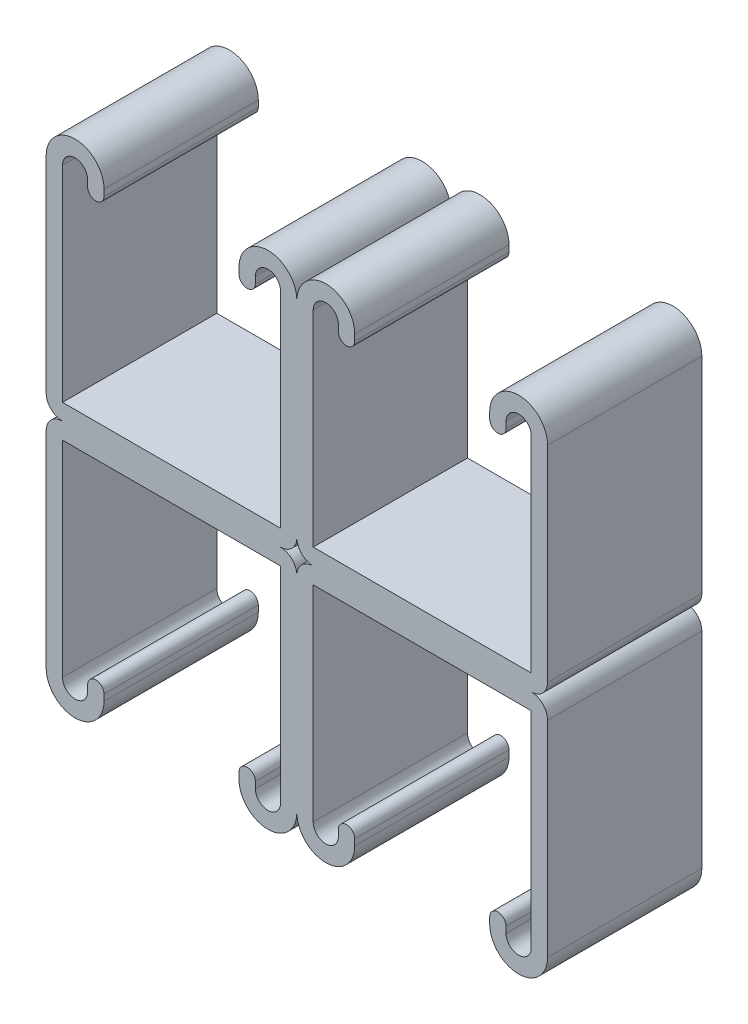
ISO-10303-21;
HEADER;
FILE_DESCRIPTION(('STEP AP214'),'2;1');
FILE_NAME('part.step','',(''),(''),'','','');
FILE_SCHEMA(('AUTOMOTIVE_DESIGN { 1 0 10303 214 1 1 1 1 }'));
ENDSEC;
DATA;
#1=APPLICATION_CONTEXT('core data for automotive mechanical design processes');
#2=APPLICATION_PROTOCOL_DEFINITION('international standard','automotive_design',2000,#1);
#3=PRODUCT_CONTEXT('',#1,'mechanical');
#4=PRODUCT('Part','Part','',(#3));
#5=PRODUCT_RELATED_PRODUCT_CATEGORY('part','',(#4));
#6=PRODUCT_DEFINITION_FORMATION('','',#4);
#7=PRODUCT_DEFINITION_CONTEXT('part definition',#1,'design');
#8=PRODUCT_DEFINITION('design','',#6,#7);
#9=PRODUCT_DEFINITION_SHAPE('','',#8);
#10=(LENGTH_UNIT() NAMED_UNIT(*) SI_UNIT(.MILLI.,.METRE.));
#11=(NAMED_UNIT(*) PLANE_ANGLE_UNIT() SI_UNIT($,.RADIAN.));
#12=(NAMED_UNIT(*) SI_UNIT($,.STERADIAN.) SOLID_ANGLE_UNIT());
#13=UNCERTAINTY_MEASURE_WITH_UNIT(LENGTH_MEASURE(1.E-05),#10,'distance_accuracy_value','');
#14=(GEOMETRIC_REPRESENTATION_CONTEXT(3) GLOBAL_UNCERTAINTY_ASSIGNED_CONTEXT((#13)) GLOBAL_UNIT_ASSIGNED_CONTEXT((#10,
#11,#12)) REPRESENTATION_CONTEXT('',''));
#15=CARTESIAN_POINT('',(0.,0.,0.));
#16=DIRECTION('',(0.,0.,1.));
#17=DIRECTION('',(1.,0.,0.));
#18=AXIS2_PLACEMENT_3D('',#15,#16,#17);
#19=CARTESIAN_POINT('',(4.7625,36.5125,12.7));
#20=DIRECTION('',(0.,0.,-1.));
#21=DIRECTION('',(-1.,0.,0.));
#22=AXIS2_PLACEMENT_3D('',#19,#20,#21);
#23=CYLINDRICAL_SURFACE('',#22,4.7625);
#24=CARTESIAN_POINT('',(4.7625,36.5125,-12.7));
#25=DIRECTION('',(0.,0.,1.));
#26=DIRECTION('',(-1.,0.,0.));
#27=AXIS2_PLACEMENT_3D('',#24,#25,#26);
#28=CIRCLE('',#27,4.7625);
#29=CARTESIAN_POINT('',(9.525,36.5125,-12.7));
#30=VERTEX_POINT('',#29);
#31=CARTESIAN_POINT('',(0.,36.5125,-12.7));
#32=VERTEX_POINT('',#31);
#33=EDGE_CURVE('E204',#30,#32,#28,.T.);
#34=ORIENTED_EDGE('',*,*,#33,.T.);
#35=DIRECTION('',(0.,0.,-1.));
#36=VECTOR('',#35,1.);
#37=CARTESIAN_POINT('',(0.,36.5125,12.7));
#38=LINE('',#37,#36);
#39=CARTESIAN_POINT('',(0.,36.5125,12.7));
#40=VERTEX_POINT('',#39);
#41=EDGE_CURVE('E11',#40,#32,#38,.T.);
#42=ORIENTED_EDGE('',*,*,#41,.F.);
#43=CARTESIAN_POINT('',(4.7625,36.5125,12.7));
#44=DIRECTION('',(0.,0.,1.));
#45=DIRECTION('',(-1.,0.,0.));
#46=AXIS2_PLACEMENT_3D('',#43,#44,#45);
#47=CIRCLE('',#46,4.7625);
#48=CARTESIAN_POINT('',(9.525,36.5125,12.7));
#49=VERTEX_POINT('',#48);
#50=EDGE_CURVE('E121',#49,#40,#47,.T.);
#51=ORIENTED_EDGE('',*,*,#50,.F.);
#52=DIRECTION('',(0.,0.,-1.));
#53=VECTOR('',#52,1.);
#54=CARTESIAN_POINT('',(9.525,36.5125,12.7));
#55=LINE('',#54,#53);
#56=EDGE_CURVE('E201',#49,#30,#55,.T.);
#57=ORIENTED_EDGE('',*,*,#56,.T.);
#58=EDGE_LOOP('',(#34,#42,#51,#57));
#59=FACE_BOUND('',#58,.T.);
#60=ADVANCED_FACE('F41',(#59),#23,.T.);
#61=CARTESIAN_POINT('',(2.6924,2.6924,12.7));
#62=DIRECTION('',(0.,0.,-1.));
#63=DIRECTION('',(-1.,0.,0.));
#64=AXIS2_PLACEMENT_3D('',#61,#62,#63);
#65=CYLINDRICAL_SURFACE('',#64,2.6924);
#66=CARTESIAN_POINT('',(2.6924,2.6924,-12.7));
#67=DIRECTION('',(0.,0.,1.));
#68=DIRECTION('',(-1.,0.,0.));
#69=AXIS2_PLACEMENT_3D('',#66,#67,#68);
#70=CIRCLE('',#69,2.6924);
#71=CARTESIAN_POINT('',(0.,2.6924,-12.7));
#72=VERTEX_POINT('',#71);
#73=CARTESIAN_POINT('',(2.6924,0.,-12.7));
#74=VERTEX_POINT('',#73);
#75=EDGE_CURVE('E206',#72,#74,#70,.T.);
#76=ORIENTED_EDGE('',*,*,#75,.T.);
#77=DIRECTION('',(0.,0.,-1.));
#78=VECTOR('',#77,1.);
#79=CARTESIAN_POINT('',(2.6924,0.,12.7));
#80=LINE('',#79,#78);
#81=CARTESIAN_POINT('',(2.6924,0.,12.7));
#82=VERTEX_POINT('',#81);
#83=EDGE_CURVE('E299',#82,#74,#80,.T.);
#84=ORIENTED_EDGE('',*,*,#83,.F.);
#85=CARTESIAN_POINT('',(2.6924,2.6924,12.7));
#86=DIRECTION('',(0.,0.,1.));
#87=DIRECTION('',(-1.,0.,0.));
#88=AXIS2_PLACEMENT_3D('',#85,#86,#87);
#89=CIRCLE('',#88,2.6924);
#90=CARTESIAN_POINT('',(0.,2.6924,12.7));
#91=VERTEX_POINT('',#90);
#92=EDGE_CURVE('E311',#91,#82,#89,.T.);
#93=ORIENTED_EDGE('',*,*,#92,.F.);
#94=DIRECTION('',(0.,0.,-1.));
#95=VECTOR('',#94,1.);
#96=CARTESIAN_POINT('',(0.,2.6924,12.7));
#97=LINE('',#96,#95);
#98=EDGE_CURVE('E49',#91,#72,#97,.T.);
#99=ORIENTED_EDGE('',*,*,#98,.T.);
#100=EDGE_LOOP('',(#76,#84,#93,#99));
#101=FACE_BOUND('',#100,.T.);
#102=ADVANCED_FACE('F308',(#101),#65,.T.);
#103=CARTESIAN_POINT('',(38.5826,2.6924,12.7));
#104=DIRECTION('',(0.,0.,-1.));
#105=DIRECTION('',(-1.,0.,0.));
#106=AXIS2_PLACEMENT_3D('',#103,#104,#105);
#107=CYLINDRICAL_SURFACE('',#106,2.6924);
#108=CARTESIAN_POINT('',(38.5826,2.6924,-12.7));
#109=DIRECTION('',(0.,0.,1.));
#110=DIRECTION('',(1.,0.,0.));
#111=AXIS2_PLACEMENT_3D('',#108,#109,#110);
#112=CIRCLE('',#111,2.6924);
#113=CARTESIAN_POINT('',(38.5826,0.,-12.7));
#114=VERTEX_POINT('',#113);
#115=CARTESIAN_POINT('',(41.275,2.6924,-12.7));
#116=VERTEX_POINT('',#115);
#117=EDGE_CURVE('E214',#114,#116,#112,.T.);
#118=ORIENTED_EDGE('',*,*,#117,.T.);
#119=DIRECTION('',(0.,0.,-1.));
#120=VECTOR('',#119,1.);
#121=CARTESIAN_POINT('',(41.275,2.6924,12.7));
#122=LINE('',#121,#120);
#123=CARTESIAN_POINT('',(41.275,2.6924,12.7));
#124=VERTEX_POINT('',#123);
#125=EDGE_CURVE('E293',#124,#116,#122,.T.);
#126=ORIENTED_EDGE('',*,*,#125,.F.);
#127=CARTESIAN_POINT('',(38.5826,2.6924,12.7));
#128=DIRECTION('',(0.,0.,1.));
#129=DIRECTION('',(1.,0.,0.));
#130=AXIS2_PLACEMENT_3D('',#127,#128,#129);
#131=CIRCLE('',#130,2.6924);
#132=CARTESIAN_POINT('',(38.5826,0.,12.7));
#133=VERTEX_POINT('',#132);
#134=EDGE_CURVE('E409',#133,#124,#131,.T.);
#135=ORIENTED_EDGE('',*,*,#134,.F.);
#136=DIRECTION('',(0.,0.,-1.));
#137=VECTOR('',#136,1.);
#138=CARTESIAN_POINT('',(38.5826,0.,12.7));
#139=LINE('',#138,#137);
#140=EDGE_CURVE('E294',#133,#114,#139,.T.);
#141=ORIENTED_EDGE('',*,*,#140,.T.);
#142=EDGE_LOOP('',(#118,#126,#135,#141));
#143=FACE_BOUND('',#142,.T.);
#144=ADVANCED_FACE('F1141',(#143),#107,.T.);
#145=CARTESIAN_POINT('',(41.275,2.6924,12.7));
#146=DIRECTION('',(-1.,0.,0.));
#147=DIRECTION('',(0.,0.,1.));
#148=AXIS2_PLACEMENT_3D('',#145,#146,#147);
#149=PLANE('',#148);
#150=DIRECTION('',(0.,1.,0.));
#151=VECTOR('',#150,1.);
#152=CARTESIAN_POINT('',(41.275,2.6924,-12.7));
#153=LINE('',#152,#151);
#154=CARTESIAN_POINT('',(41.275,36.5125,-12.7));
#155=VERTEX_POINT('',#154);
#156=EDGE_CURVE('E211',#116,#155,#153,.T.);
#157=ORIENTED_EDGE('',*,*,#156,.T.);
#158=DIRECTION('',(0.,0.,-1.));
#159=VECTOR('',#158,1.);
#160=CARTESIAN_POINT('',(41.275,36.5125,12.7));
#161=LINE('',#160,#159);
#162=CARTESIAN_POINT('',(41.275,36.5125,12.7));
#163=VERTEX_POINT('',#162);
#164=EDGE_CURVE('E290',#163,#155,#161,.T.);
#165=ORIENTED_EDGE('',*,*,#164,.F.);
#166=DIRECTION('',(0.,1.,0.));
#167=VECTOR('',#166,1.);
#168=CARTESIAN_POINT('',(41.275,2.6924,12.7));
#169=LINE('',#168,#167);
#170=EDGE_CURVE('E406',#124,#163,#169,.T.);
#171=ORIENTED_EDGE('',*,*,#170,.F.);
#172=ORIENTED_EDGE('',*,*,#125,.T.);
#173=EDGE_LOOP('',(#157,#165,#171,#172));
#174=FACE_BOUND('',#173,.T.);
#175=ADVANCED_FACE('F1146',(#174),#149,.F.);
#176=CARTESIAN_POINT('',(36.5125,36.5125,12.7));
#177=DIRECTION('',(0.,0.,-1.));
#178=DIRECTION('',(-1.,0.,0.));
#179=AXIS2_PLACEMENT_3D('',#176,#177,#178);
#180=CYLINDRICAL_SURFACE('',#179,4.7625);
#181=CARTESIAN_POINT('',(36.5125,36.5125,-12.7));
#182=DIRECTION('',(0.,0.,1.));
#183=DIRECTION('',(1.,0.,0.));
#184=AXIS2_PLACEMENT_3D('',#181,#182,#183);
#185=CIRCLE('',#184,4.7625);
#186=CARTESIAN_POINT('',(31.75,36.5125,-12.7));
#187=VERTEX_POINT('',#186);
#188=EDGE_CURVE('E216',#155,#187,#185,.T.);
#189=ORIENTED_EDGE('',*,*,#188,.T.);
#190=DIRECTION('',(0.,0.,-1.));
#191=VECTOR('',#190,1.);
#192=CARTESIAN_POINT('',(31.75,36.5125,12.7));
#193=LINE('',#192,#191);
#194=CARTESIAN_POINT('',(31.75,36.5125,12.7));
#195=VERTEX_POINT('',#194);
#196=EDGE_CURVE('E281',#195,#187,#193,.T.);
#197=ORIENTED_EDGE('',*,*,#196,.F.);
#198=CARTESIAN_POINT('',(36.5125,36.5125,12.7));
#199=DIRECTION('',(0.,0.,1.));
#200=DIRECTION('',(1.,0.,0.));
#201=AXIS2_PLACEMENT_3D('',#198,#199,#200);
#202=CIRCLE('',#201,4.7625);
#203=EDGE_CURVE('E411',#163,#195,#202,.T.);
#204=ORIENTED_EDGE('',*,*,#203,.F.);
#205=ORIENTED_EDGE('',*,*,#164,.T.);
#206=EDGE_LOOP('',(#189,#197,#204,#205));
#207=FACE_BOUND('',#206,.T.);
#208=ADVANCED_FACE('F1151',(#207),#180,.T.);
#209=CARTESIAN_POINT('',(31.75,36.5125,12.7));
#210=DIRECTION('',(1.,0.,0.));
#211=DIRECTION('',(0.,0.,-1.));
#212=AXIS2_PLACEMENT_3D('',#209,#210,#211);
#213=PLANE('',#212);
#214=DIRECTION('',(0.,-1.,0.));
#215=VECTOR('',#214,1.);
#216=CARTESIAN_POINT('',(31.75,36.5125,-12.7));
#217=LINE('',#216,#215);
#218=CARTESIAN_POINT('',(31.75,35.47745,-12.7));
#219=VERTEX_POINT('',#218);
#220=EDGE_CURVE('E221',#187,#219,#217,.T.);
#221=ORIENTED_EDGE('',*,*,#220,.T.);
#222=DIRECTION('',(0.,0.,-1.));
#223=VECTOR('',#222,1.);
#224=CARTESIAN_POINT('',(31.75,35.47745,12.7));
#225=LINE('',#224,#223);
#226=CARTESIAN_POINT('',(31.75,35.47745,12.7));
#227=VERTEX_POINT('',#226);
#228=EDGE_CURVE('E280',#227,#219,#225,.T.);
#229=ORIENTED_EDGE('',*,*,#228,.F.);
#230=DIRECTION('',(0.,-1.,0.));
#231=VECTOR('',#230,1.);
#232=CARTESIAN_POINT('',(31.75,36.5125,12.7));
#233=LINE('',#232,#231);
#234=EDGE_CURVE('E416',#195,#227,#233,.T.);
#235=ORIENTED_EDGE('',*,*,#234,.F.);
#236=ORIENTED_EDGE('',*,*,#196,.T.);
#237=EDGE_LOOP('',(#221,#229,#235,#236));
#238=FACE_BOUND('',#237,.T.);
#239=ADVANCED_FACE('F1160',(#238),#213,.F.);
#240=CARTESIAN_POINT('',(33.0962,35.47745,12.7));
#241=DIRECTION('',(0.,0.,-1.));
#242=DIRECTION('',(-1.,0.,0.));
#243=AXIS2_PLACEMENT_3D('',#240,#241,#242);
#244=CYLINDRICAL_SURFACE('',#243,1.3462);
#245=CARTESIAN_POINT('',(33.0962,35.47745,-12.7));
#246=DIRECTION('',(0.,0.,1.));
#247=DIRECTION('',(1.,0.,0.));
#248=AXIS2_PLACEMENT_3D('',#245,#246,#247);
#249=CIRCLE('',#248,1.3462);
#250=CARTESIAN_POINT('',(34.4424,35.47745,-12.7));
#251=VERTEX_POINT('',#250);
#252=EDGE_CURVE('E223',#219,#251,#249,.T.);
#253=ORIENTED_EDGE('',*,*,#252,.T.);
#254=DIRECTION('',(0.,0.,-1.));
#255=VECTOR('',#254,1.);
#256=CARTESIAN_POINT('',(34.4424,35.47745,12.7));
#257=LINE('',#256,#255);
#258=CARTESIAN_POINT('',(34.4424,35.47745,12.7));
#259=VERTEX_POINT('',#258);
#260=EDGE_CURVE('E273',#259,#251,#257,.T.);
#261=ORIENTED_EDGE('',*,*,#260,.F.);
#262=CARTESIAN_POINT('',(33.0962,35.47745,12.7));
#263=DIRECTION('',(0.,0.,1.));
#264=DIRECTION('',(1.,0.,0.));
#265=AXIS2_PLACEMENT_3D('',#262,#263,#264);
#266=CIRCLE('',#265,1.3462);
#267=EDGE_CURVE('E418',#227,#259,#266,.T.);
#268=ORIENTED_EDGE('',*,*,#267,.F.);
#269=ORIENTED_EDGE('',*,*,#228,.T.);
#270=EDGE_LOOP('',(#253,#261,#268,#269));
#271=FACE_BOUND('',#270,.T.);
#272=ADVANCED_FACE('F1162',(#271),#244,.T.);
#273=CARTESIAN_POINT('',(34.4424,36.5125,12.7));
#274=DIRECTION('',(-1.,0.,0.));
#275=DIRECTION('',(0.,0.,1.));
#276=AXIS2_PLACEMENT_3D('',#273,#274,#275);
#277=PLANE('',#276);
#278=DIRECTION('',(0.,1.,0.));
#279=VECTOR('',#278,1.);
#280=CARTESIAN_POINT('',(34.4424,36.5125,-12.7));
#281=LINE('',#280,#279);
#282=CARTESIAN_POINT('',(34.4424,36.5125,-12.7));
#283=VERTEX_POINT('',#282);
#284=EDGE_CURVE('E227',#251,#283,#281,.T.);
#285=ORIENTED_EDGE('',*,*,#284,.T.);
#286=DIRECTION('',(0.,0.,-1.));
#287=VECTOR('',#286,1.);
#288=CARTESIAN_POINT('',(34.4424,36.5125,12.7));
#289=LINE('',#288,#287);
#290=CARTESIAN_POINT('',(34.4424,36.5125,12.7));
#291=VERTEX_POINT('',#290);
#292=EDGE_CURVE('E272',#291,#283,#289,.T.);
#293=ORIENTED_EDGE('',*,*,#292,.F.);
#294=DIRECTION('',(0.,1.,0.));
#295=VECTOR('',#294,1.);
#296=CARTESIAN_POINT('',(34.4424,36.5125,12.7));
#297=LINE('',#296,#295);
#298=EDGE_CURVE('E422',#259,#291,#297,.T.);
#299=ORIENTED_EDGE('',*,*,#298,.F.);
#300=ORIENTED_EDGE('',*,*,#260,.T.);
#301=EDGE_LOOP('',(#285,#293,#299,#300));
#302=FACE_BOUND('',#301,.T.);
#303=ADVANCED_FACE('F1168',(#302),#277,.F.);
#304=CARTESIAN_POINT('',(36.5125,36.5125,12.7));
#305=DIRECTION('',(0.,0.,-1.));
#306=DIRECTION('',(-1.,0.,0.));
#307=AXIS2_PLACEMENT_3D('',#304,#305,#306);
#308=CYLINDRICAL_SURFACE('',#307,2.0701);
#309=CARTESIAN_POINT('',(36.5125,36.5125,-12.7));
#310=DIRECTION('',(0.,0.,-1.));
#311=DIRECTION('',(1.,0.,0.));
#312=AXIS2_PLACEMENT_3D('',#309,#310,#311);
#313=CIRCLE('',#312,2.0701);
#314=CARTESIAN_POINT('',(38.5826,36.5125,-12.7));
#315=VERTEX_POINT('',#314);
#316=EDGE_CURVE('E229',#283,#315,#313,.T.);
#317=ORIENTED_EDGE('',*,*,#316,.T.);
#318=DIRECTION('',(0.,0.,-1.));
#319=VECTOR('',#318,1.);
#320=CARTESIAN_POINT('',(38.5826,36.5125,12.7));
#321=LINE('',#320,#319);
#322=CARTESIAN_POINT('',(38.5826,36.5125,12.7));
#323=VERTEX_POINT('',#322);
#324=EDGE_CURVE('E270',#323,#315,#321,.T.);
#325=ORIENTED_EDGE('',*,*,#324,.F.);
#326=CARTESIAN_POINT('',(36.5125,36.5125,12.7));
#327=DIRECTION('',(0.,0.,-1.));
#328=DIRECTION('',(1.,0.,0.));
#329=AXIS2_PLACEMENT_3D('',#326,#327,#328);
#330=CIRCLE('',#329,2.0701);
#331=EDGE_CURVE('E424',#291,#323,#330,.T.);
#332=ORIENTED_EDGE('',*,*,#331,.F.);
#333=ORIENTED_EDGE('',*,*,#292,.T.);
#334=EDGE_LOOP('',(#317,#325,#332,#333));
#335=FACE_BOUND('',#334,.T.);
#336=ADVANCED_FACE('F1175',(#335),#308,.F.);
#337=CARTESIAN_POINT('',(38.5826,2.6924,12.7));
#338=DIRECTION('',(1.,0.,0.));
#339=DIRECTION('',(0.,1.,0.));
#340=AXIS2_PLACEMENT_3D('',#337,#338,#339);
#341=PLANE('',#340);
#342=DIRECTION('',(0.,-1.,0.));
#343=VECTOR('',#342,1.);
#344=CARTESIAN_POINT('',(38.5826,2.6924,-12.7));
#345=LINE('',#344,#343);
#346=CARTESIAN_POINT('',(38.5826,2.6924,-12.7));
#347=VERTEX_POINT('',#346);
#348=EDGE_CURVE('E231',#315,#347,#345,.T.);
#349=ORIENTED_EDGE('',*,*,#348,.T.);
#350=DIRECTION('',(0.,0.,-1.));
#351=VECTOR('',#350,1.);
#352=CARTESIAN_POINT('',(38.5826,2.6924,12.7));
#353=LINE('',#352,#351);
#354=CARTESIAN_POINT('',(38.5826,2.6924,12.7));
#355=VERTEX_POINT('',#354);
#356=EDGE_CURVE('E261',#355,#347,#353,.T.);
#357=ORIENTED_EDGE('',*,*,#356,.F.);
#358=DIRECTION('',(0.,-1.,0.));
#359=VECTOR('',#358,1.);
#360=CARTESIAN_POINT('',(38.5826,2.6924,12.7));
#361=LINE('',#360,#359);
#362=EDGE_CURVE('E426',#323,#355,#361,.T.);
#363=ORIENTED_EDGE('',*,*,#362,.F.);
#364=ORIENTED_EDGE('',*,*,#324,.T.);
#365=EDGE_LOOP('',(#349,#357,#363,#364));
#366=FACE_BOUND('',#365,.T.);
#367=ADVANCED_FACE('F1176',(#366),#341,.F.);
#368=CARTESIAN_POINT('',(2.6924,2.6924,12.7));
#369=DIRECTION('',(0.,-1.,0.));
#370=DIRECTION('',(1.,0.,0.));
#371=AXIS2_PLACEMENT_3D('',#368,#369,#370);
#372=PLANE('',#371);
#373=DIRECTION('',(-1.,0.,0.));
#374=VECTOR('',#373,1.);
#375=CARTESIAN_POINT('',(2.6924,2.6924,-12.7));
#376=LINE('',#375,#374);
#377=CARTESIAN_POINT('',(2.6924,2.6924,-12.7));
#378=VERTEX_POINT('',#377);
#379=EDGE_CURVE('E236',#347,#378,#376,.T.);
#380=ORIENTED_EDGE('',*,*,#379,.T.);
#381=DIRECTION('',(0.,0.,-1.));
#382=VECTOR('',#381,1.);
#383=CARTESIAN_POINT('',(2.6924,2.6924,12.7));
#384=LINE('',#383,#382);
#385=CARTESIAN_POINT('',(2.6924,2.6924,12.7));
#386=VERTEX_POINT('',#385);
#387=EDGE_CURVE('E260',#386,#378,#384,.T.);
#388=ORIENTED_EDGE('',*,*,#387,.F.);
#389=DIRECTION('',(-1.,0.,0.));
#390=VECTOR('',#389,1.);
#391=CARTESIAN_POINT('',(2.6924,2.6924,12.7));
#392=LINE('',#391,#390);
#393=EDGE_CURVE('E431',#355,#386,#392,.T.);
#394=ORIENTED_EDGE('',*,*,#393,.F.);
#395=ORIENTED_EDGE('',*,*,#356,.T.);
#396=EDGE_LOOP('',(#380,#388,#394,#395));
#397=FACE_BOUND('',#396,.T.);
#398=ADVANCED_FACE('F1178',(#397),#372,.F.);
#399=CARTESIAN_POINT('',(2.6924,36.5125,12.7));
#400=DIRECTION('',(-1.,0.,0.));
#401=DIRECTION('',(0.,-1.,0.));
#402=AXIS2_PLACEMENT_3D('',#399,#400,#401);
#403=PLANE('',#402);
#404=DIRECTION('',(0.,1.,0.));
#405=VECTOR('',#404,1.);
#406=CARTESIAN_POINT('',(2.6924,36.5125,-12.7));
#407=LINE('',#406,#405);
#408=CARTESIAN_POINT('',(2.6924,36.5125,-12.7));
#409=VERTEX_POINT('',#408);
#410=EDGE_CURVE('E237',#378,#409,#407,.T.);
#411=ORIENTED_EDGE('',*,*,#410,.T.);
#412=DIRECTION('',(0.,0.,-1.));
#413=VECTOR('',#412,1.);
#414=CARTESIAN_POINT('',(2.6924,36.5125,12.7));
#415=LINE('',#414,#413);
#416=CARTESIAN_POINT('',(2.6924,36.5125,12.7));
#417=VERTEX_POINT('',#416);
#418=EDGE_CURVE('E253',#417,#409,#415,.T.);
#419=ORIENTED_EDGE('',*,*,#418,.F.);
#420=DIRECTION('',(0.,1.,0.));
#421=VECTOR('',#420,1.);
#422=CARTESIAN_POINT('',(2.6924,36.5125,12.7));
#423=LINE('',#422,#421);
#424=EDGE_CURVE('E432',#386,#417,#423,.T.);
#425=ORIENTED_EDGE('',*,*,#424,.F.);
#426=ORIENTED_EDGE('',*,*,#387,.T.);
#427=EDGE_LOOP('',(#411,#419,#425,#426));
#428=FACE_BOUND('',#427,.T.);
#429=ADVANCED_FACE('F483',(#428),#403,.F.);
#430=CARTESIAN_POINT('',(4.7625,36.5125,12.7));
#431=DIRECTION('',(0.,0.,-1.));
#432=DIRECTION('',(-1.,0.,0.));
#433=AXIS2_PLACEMENT_3D('',#430,#431,#432);
#434=CYLINDRICAL_SURFACE('',#433,2.0701);
#435=CARTESIAN_POINT('',(4.7625,36.5125,-12.7));
#436=DIRECTION('',(0.,0.,-1.));
#437=DIRECTION('',(-1.,0.,0.));
#438=AXIS2_PLACEMENT_3D('',#435,#436,#437);
#439=CIRCLE('',#438,2.0701);
#440=CARTESIAN_POINT('',(6.8326,36.5125,-12.7));
#441=VERTEX_POINT('',#440);
#442=EDGE_CURVE('E245',#409,#441,#439,.T.);
#443=ORIENTED_EDGE('',*,*,#442,.T.);
#444=DIRECTION('',(0.,0.,-1.));
#445=VECTOR('',#444,1.);
#446=CARTESIAN_POINT('',(6.8326,36.5125,12.7));
#447=LINE('',#446,#445);
#448=CARTESIAN_POINT('',(6.8326,36.5125,12.7));
#449=VERTEX_POINT('',#448);
#450=EDGE_CURVE('E193',#449,#441,#447,.T.);
#451=ORIENTED_EDGE('',*,*,#450,.F.);
#452=CARTESIAN_POINT('',(4.7625,36.5125,12.7));
#453=DIRECTION('',(0.,0.,-1.));
#454=DIRECTION('',(-1.,0.,0.));
#455=AXIS2_PLACEMENT_3D('',#452,#453,#454);
#456=CIRCLE('',#455,2.0701);
#457=EDGE_CURVE('E179',#417,#449,#456,.T.);
#458=ORIENTED_EDGE('',*,*,#457,.F.);
#459=ORIENTED_EDGE('',*,*,#418,.T.);
#460=EDGE_LOOP('',(#443,#451,#458,#459));
#461=FACE_BOUND('',#460,.T.);
#462=ADVANCED_FACE('F486',(#461),#434,.F.);
#463=CARTESIAN_POINT('',(6.8326,36.5125,12.7));
#464=DIRECTION('',(1.,0.,0.));
#465=DIRECTION('',(0.,0.,-1.));
#466=AXIS2_PLACEMENT_3D('',#463,#464,#465);
#467=PLANE('',#466);
#468=DIRECTION('',(0.,-1.,0.));
#469=VECTOR('',#468,1.);
#470=CARTESIAN_POINT('',(6.8326,36.5125,-12.7));
#471=LINE('',#470,#469);
#472=CARTESIAN_POINT('',(6.8326,35.47745,-12.7));
#473=VERTEX_POINT('',#472);
#474=EDGE_CURVE('E186',#441,#473,#471,.T.);
#475=ORIENTED_EDGE('',*,*,#474,.T.);
#476=DIRECTION('',(0.,0.,-1.));
#477=VECTOR('',#476,1.);
#478=CARTESIAN_POINT('',(6.8326,35.47745,12.7));
#479=LINE('',#478,#477);
#480=CARTESIAN_POINT('',(6.8326,35.47745,12.7));
#481=VERTEX_POINT('',#480);
#482=EDGE_CURVE('E187',#481,#473,#479,.T.);
#483=ORIENTED_EDGE('',*,*,#482,.F.);
#484=DIRECTION('',(0.,-1.,0.));
#485=VECTOR('',#484,1.);
#486=CARTESIAN_POINT('',(6.8326,36.5125,12.7));
#487=LINE('',#486,#485);
#488=EDGE_CURVE('E175',#449,#481,#487,.T.);
#489=ORIENTED_EDGE('',*,*,#488,.F.);
#490=ORIENTED_EDGE('',*,*,#450,.T.);
#491=EDGE_LOOP('',(#475,#483,#489,#490));
#492=FACE_BOUND('',#491,.T.);
#493=ADVANCED_FACE('F190',(#492),#467,.F.);
#494=CARTESIAN_POINT('',(8.1788,35.47745,12.7));
#495=DIRECTION('',(0.,0.,-1.));
#496=DIRECTION('',(-1.,0.,0.));
#497=AXIS2_PLACEMENT_3D('',#494,#495,#496);
#498=CYLINDRICAL_SURFACE('',#497,1.3462);
#499=CARTESIAN_POINT('',(8.1788,35.47745,-12.7));
#500=DIRECTION('',(0.,0.,1.));
#501=DIRECTION('',(-1.,0.,0.));
#502=AXIS2_PLACEMENT_3D('',#499,#500,#501);
#503=CIRCLE('',#502,1.3462);
#504=CARTESIAN_POINT('',(9.525,35.47745,-12.7));
#505=VERTEX_POINT('',#504);
#506=EDGE_CURVE('E115',#473,#505,#503,.T.);
#507=ORIENTED_EDGE('',*,*,#506,.T.);
#508=DIRECTION('',(0.,0.,-1.));
#509=VECTOR('',#508,1.);
#510=CARTESIAN_POINT('',(9.525,35.47745,12.7));
#511=LINE('',#510,#509);
#512=CARTESIAN_POINT('',(9.525,35.47745,12.7));
#513=VERTEX_POINT('',#512);
#514=EDGE_CURVE('E194',#513,#505,#511,.T.);
#515=ORIENTED_EDGE('',*,*,#514,.F.);
#516=CARTESIAN_POINT('',(8.1788,35.47745,12.7));
#517=DIRECTION('',(0.,0.,1.));
#518=DIRECTION('',(-1.,0.,0.));
#519=AXIS2_PLACEMENT_3D('',#516,#517,#518);
#520=CIRCLE('',#519,1.3462);
#521=EDGE_CURVE('E178',#481,#513,#520,.T.);
#522=ORIENTED_EDGE('',*,*,#521,.F.);
#523=ORIENTED_EDGE('',*,*,#482,.T.);
#524=EDGE_LOOP('',(#507,#515,#522,#523));
#525=FACE_BOUND('',#524,.T.);
#526=ADVANCED_FACE('F195',(#525),#498,.T.);
#527=CARTESIAN_POINT('',(9.525,36.5125,12.7));
#528=DIRECTION('',(-1.,0.,0.));
#529=DIRECTION('',(0.,-1.,0.));
#530=AXIS2_PLACEMENT_3D('',#527,#528,#529);
#531=PLANE('',#530);
#532=DIRECTION('',(0.,1.,0.));
#533=VECTOR('',#532,1.);
#534=CARTESIAN_POINT('',(9.525,36.5125,-12.7));
#535=LINE('',#534,#533);
#536=EDGE_CURVE('E117',#505,#30,#535,.T.);
#537=ORIENTED_EDGE('',*,*,#536,.T.);
#538=ORIENTED_EDGE('',*,*,#56,.F.);
#539=DIRECTION('',(0.,1.,0.));
#540=VECTOR('',#539,1.);
#541=CARTESIAN_POINT('',(9.525,36.5125,12.7));
#542=LINE('',#541,#540);
#543=EDGE_CURVE('E59',#513,#49,#542,.T.);
#544=ORIENTED_EDGE('',*,*,#543,.F.);
#545=ORIENTED_EDGE('',*,*,#514,.T.);
#546=EDGE_LOOP('',(#537,#538,#544,#545));
#547=FACE_BOUND('',#546,.T.);
#548=ADVANCED_FACE('F1258',(#547),#531,.F.);
#549=CARTESIAN_POINT('',(4.7625,36.5125,12.7));
#550=DIRECTION('',(0.,0.,-1.));
#551=DIRECTION('',(-1.,0.,0.));
#552=AXIS2_PLACEMENT_3D('',#549,#550,#551);
#553=PLANE('',#552);
#554=CARTESIAN_POINT('',(-38.5826,2.6924,12.7));
#555=DIRECTION('',(0.,0.,-1.));
#556=DIRECTION('',(-1.,0.,0.));
#557=AXIS2_PLACEMENT_3D('',#554,#555,#556);
#558=CIRCLE('',#557,2.6924);
#559=CARTESIAN_POINT('',(-38.5826,0.,12.7));
#560=VERTEX_POINT('',#559);
#561=CARTESIAN_POINT('',(-41.275,2.6924,12.7));
#562=VERTEX_POINT('',#561);
#563=EDGE_CURVE('E562',#560,#562,#558,.T.);
#564=ORIENTED_EDGE('',*,*,#563,.F.);
#565=CARTESIAN_POINT('',(-38.5826,-2.6924,12.7));
#566=DIRECTION('',(0.,0.,1.));
#567=DIRECTION('',(-1.,0.,0.));
#568=AXIS2_PLACEMENT_3D('',#565,#566,#567);
#569=CIRCLE('',#568,2.6924);
#570=CARTESIAN_POINT('',(-41.275,-2.6924,12.7));
#571=VERTEX_POINT('',#570);
#572=EDGE_CURVE('E1744',#560,#571,#569,.T.);
#573=ORIENTED_EDGE('',*,*,#572,.T.);
#574=DIRECTION('',(0.,-1.,0.));
#575=VECTOR('',#574,1.);
#576=CARTESIAN_POINT('',(-41.275,-2.6924,12.7));
#577=LINE('',#576,#575);
#578=CARTESIAN_POINT('',(-41.275,-36.5125,12.7));
#579=VERTEX_POINT('',#578);
#580=EDGE_CURVE('E1748',#571,#579,#577,.T.);
#581=ORIENTED_EDGE('',*,*,#580,.T.);
#582=CARTESIAN_POINT('',(-36.5125,-36.5125,12.7));
#583=DIRECTION('',(0.,0.,1.));
#584=DIRECTION('',(-1.,0.,0.));
#585=AXIS2_PLACEMENT_3D('',#582,#583,#584);
#586=CIRCLE('',#585,4.7625);
#587=CARTESIAN_POINT('',(-31.75,-36.5125,12.7));
#588=VERTEX_POINT('',#587);
#589=EDGE_CURVE('E1751',#579,#588,#586,.T.);
#590=ORIENTED_EDGE('',*,*,#589,.T.);
#591=DIRECTION('',(0.,1.,0.));
#592=VECTOR('',#591,1.);
#593=CARTESIAN_POINT('',(-31.75,-36.5125,12.7));
#594=LINE('',#593,#592);
#595=CARTESIAN_POINT('',(-31.75,-35.47745,12.7));
#596=VERTEX_POINT('',#595);
#597=EDGE_CURVE('E1756',#588,#596,#594,.T.);
#598=ORIENTED_EDGE('',*,*,#597,.T.);
#599=CARTESIAN_POINT('',(-33.0962,-35.47745,12.7));
#600=DIRECTION('',(0.,0.,1.));
#601=DIRECTION('',(-1.,0.,0.));
#602=AXIS2_PLACEMENT_3D('',#599,#600,#601);
#603=CIRCLE('',#602,1.3462);
#604=CARTESIAN_POINT('',(-34.4424,-35.47745,12.7));
#605=VERTEX_POINT('',#604);
#606=EDGE_CURVE('E1761',#596,#605,#603,.T.);
#607=ORIENTED_EDGE('',*,*,#606,.T.);
#608=DIRECTION('',(0.,-1.,0.));
#609=VECTOR('',#608,1.);
#610=CARTESIAN_POINT('',(-34.4424,-36.5125,12.7));
#611=LINE('',#610,#609);
#612=CARTESIAN_POINT('',(-34.4424,-36.5125,12.7));
#613=VERTEX_POINT('',#612);
#614=EDGE_CURVE('E1763',#605,#613,#611,.T.);
#615=ORIENTED_EDGE('',*,*,#614,.T.);
#616=CARTESIAN_POINT('',(-36.5125,-36.5125,12.7));
#617=DIRECTION('',(0.,0.,-1.));
#618=DIRECTION('',(-1.,0.,0.));
#619=AXIS2_PLACEMENT_3D('',#616,#617,#618);
#620=CIRCLE('',#619,2.0701);
#621=CARTESIAN_POINT('',(-38.5826,-36.5125,12.7));
#622=VERTEX_POINT('',#621);
#623=EDGE_CURVE('E1770',#613,#622,#620,.T.);
#624=ORIENTED_EDGE('',*,*,#623,.T.);
#625=DIRECTION('',(0.,1.,0.));
#626=VECTOR('',#625,1.);
#627=CARTESIAN_POINT('',(-38.5826,-2.6924,12.7));
#628=LINE('',#627,#626);
#629=CARTESIAN_POINT('',(-38.5826,-2.6924,12.7));
#630=VERTEX_POINT('',#629);
#631=EDGE_CURVE('E1768',#622,#630,#628,.T.);
#632=ORIENTED_EDGE('',*,*,#631,.T.);
#633=DIRECTION('',(1.,0.,0.));
#634=VECTOR('',#633,1.);
#635=CARTESIAN_POINT('',(-2.6924,-2.6924,12.7));
#636=LINE('',#635,#634);
#637=CARTESIAN_POINT('',(-2.6924,-2.6924,12.7));
#638=VERTEX_POINT('',#637);
#639=EDGE_CURVE('E1772',#630,#638,#636,.T.);
#640=ORIENTED_EDGE('',*,*,#639,.T.);
#641=DIRECTION('',(0.,-1.,0.));
#642=VECTOR('',#641,1.);
#643=CARTESIAN_POINT('',(-2.6924,-36.5125,12.7));
#644=LINE('',#643,#642);
#645=CARTESIAN_POINT('',(-2.6924,-36.5125,12.7));
#646=VERTEX_POINT('',#645);
#647=EDGE_CURVE('E1778',#638,#646,#644,.T.);
#648=ORIENTED_EDGE('',*,*,#647,.T.);
#649=CARTESIAN_POINT('',(-4.7625,-36.5125,12.7));
#650=DIRECTION('',(0.,0.,-1.));
#651=DIRECTION('',(1.,0.,0.));
#652=AXIS2_PLACEMENT_3D('',#649,#650,#651);
#653=CIRCLE('',#652,2.0701);
#654=CARTESIAN_POINT('',(-6.8326,-36.5125,12.7));
#655=VERTEX_POINT('',#654);
#656=EDGE_CURVE('E1777',#646,#655,#653,.T.);
#657=ORIENTED_EDGE('',*,*,#656,.T.);
#658=DIRECTION('',(0.,1.,0.));
#659=VECTOR('',#658,1.);
#660=CARTESIAN_POINT('',(-6.8326,-36.5125,12.7));
#661=LINE('',#660,#659);
#662=CARTESIAN_POINT('',(-6.8326,-35.47745,12.7));
#663=VERTEX_POINT('',#662);
#664=EDGE_CURVE('E1785',#655,#663,#661,.T.);
#665=ORIENTED_EDGE('',*,*,#664,.T.);
#666=CARTESIAN_POINT('',(-8.1788,-35.47745,12.7));
#667=DIRECTION('',(0.,0.,1.));
#668=DIRECTION('',(1.,0.,0.));
#669=AXIS2_PLACEMENT_3D('',#666,#667,#668);
#670=CIRCLE('',#669,1.3462);
#671=CARTESIAN_POINT('',(-9.525,-35.47745,12.7));
#672=VERTEX_POINT('',#671);
#673=EDGE_CURVE('E1784',#663,#672,#670,.T.);
#674=ORIENTED_EDGE('',*,*,#673,.T.);
#675=DIRECTION('',(0.,-1.,0.));
#676=VECTOR('',#675,1.);
#677=CARTESIAN_POINT('',(-9.525,-36.5125,12.7));
#678=LINE('',#677,#676);
#679=CARTESIAN_POINT('',(-9.525,-36.5125,12.7));
#680=VERTEX_POINT('',#679);
#681=EDGE_CURVE('E891',#672,#680,#678,.T.);
#682=ORIENTED_EDGE('',*,*,#681,.T.);
#683=CARTESIAN_POINT('',(-4.7625,-36.5125,12.7));
#684=DIRECTION('',(0.,0.,1.));
#685=DIRECTION('',(1.,0.,0.));
#686=AXIS2_PLACEMENT_3D('',#683,#684,#685);
#687=CIRCLE('',#686,4.7625);
#688=CARTESIAN_POINT('',(0.,-36.5125,12.7));
#689=VERTEX_POINT('',#688);
#690=EDGE_CURVE('E884',#680,#689,#687,.T.);
#691=ORIENTED_EDGE('',*,*,#690,.T.);
#692=CARTESIAN_POINT('',(4.7625,-36.5125,12.7));
#693=DIRECTION('',(0.,0.,-1.));
#694=DIRECTION('',(-1.,0.,0.));
#695=AXIS2_PLACEMENT_3D('',#692,#693,#694);
#696=CIRCLE('',#695,4.7625);
#697=CARTESIAN_POINT('',(9.525,-36.5125,12.7));
#698=VERTEX_POINT('',#697);
#699=EDGE_CURVE('E888',#698,#689,#696,.T.);
#700=ORIENTED_EDGE('',*,*,#699,.F.);
#701=DIRECTION('',(0.,-1.,0.));
#702=VECTOR('',#701,1.);
#703=CARTESIAN_POINT('',(9.525,-36.5125,12.7));
#704=LINE('',#703,#702);
#705=CARTESIAN_POINT('',(9.525,-35.47745,12.7));
#706=VERTEX_POINT('',#705);
#707=EDGE_CURVE('E911',#706,#698,#704,.T.);
#708=ORIENTED_EDGE('',*,*,#707,.F.);
#709=CARTESIAN_POINT('',(8.1788,-35.47745,12.7));
#710=DIRECTION('',(0.,0.,-1.));
#711=DIRECTION('',(-1.,0.,0.));
#712=AXIS2_PLACEMENT_3D('',#709,#710,#711);
#713=CIRCLE('',#712,1.3462);
#714=CARTESIAN_POINT('',(6.8326,-35.47745,12.7));
#715=VERTEX_POINT('',#714);
#716=EDGE_CURVE('E918',#715,#706,#713,.T.);
#717=ORIENTED_EDGE('',*,*,#716,.F.);
#718=DIRECTION('',(0.,1.,0.));
#719=VECTOR('',#718,1.);
#720=CARTESIAN_POINT('',(6.8326,-36.5125,12.7));
#721=LINE('',#720,#719);
#722=CARTESIAN_POINT('',(6.8326,-36.5125,12.7));
#723=VERTEX_POINT('',#722);
#724=EDGE_CURVE('E935',#723,#715,#721,.T.);
#725=ORIENTED_EDGE('',*,*,#724,.F.);
#726=CARTESIAN_POINT('',(4.7625,-36.5125,12.7));
#727=DIRECTION('',(0.,0.,1.));
#728=DIRECTION('',(-1.,0.,0.));
#729=AXIS2_PLACEMENT_3D('',#726,#727,#728);
#730=CIRCLE('',#729,2.0701);
#731=CARTESIAN_POINT('',(2.6924,-36.5125,12.7));
#732=VERTEX_POINT('',#731);
#733=EDGE_CURVE('E936',#732,#723,#730,.T.);
#734=ORIENTED_EDGE('',*,*,#733,.F.);
#735=DIRECTION('',(0.,-1.,0.));
#736=VECTOR('',#735,1.);
#737=CARTESIAN_POINT('',(2.6924,-36.5125,12.7));
#738=LINE('',#737,#736);
#739=CARTESIAN_POINT('',(2.6924,-2.6924,12.7));
#740=VERTEX_POINT('',#739);
#741=EDGE_CURVE('E939',#740,#732,#738,.T.);
#742=ORIENTED_EDGE('',*,*,#741,.F.);
#743=DIRECTION('',(-1.,0.,0.));
#744=VECTOR('',#743,1.);
#745=CARTESIAN_POINT('',(2.6924,-2.6924,12.7));
#746=LINE('',#745,#744);
#747=CARTESIAN_POINT('',(38.5826,-2.6924,12.7));
#748=VERTEX_POINT('',#747);
#749=EDGE_CURVE('E945',#748,#740,#746,.T.);
#750=ORIENTED_EDGE('',*,*,#749,.F.);
#751=DIRECTION('',(0.,1.,0.));
#752=VECTOR('',#751,1.);
#753=CARTESIAN_POINT('',(38.5826,-2.6924,12.7));
#754=LINE('',#753,#752);
#755=CARTESIAN_POINT('',(38.5826,-36.5125,12.7));
#756=VERTEX_POINT('',#755);
#757=EDGE_CURVE('E946',#756,#748,#754,.T.);
#758=ORIENTED_EDGE('',*,*,#757,.F.);
#759=CARTESIAN_POINT('',(36.5125,-36.5125,12.7));
#760=DIRECTION('',(0.,0.,1.));
#761=DIRECTION('',(1.,0.,0.));
#762=AXIS2_PLACEMENT_3D('',#759,#760,#761);
#763=CIRCLE('',#762,2.0701);
#764=CARTESIAN_POINT('',(34.4424,-36.5125,12.7));
#765=VERTEX_POINT('',#764);
#766=EDGE_CURVE('E955',#765,#756,#763,.T.);
#767=ORIENTED_EDGE('',*,*,#766,.F.);
#768=DIRECTION('',(0.,-1.,0.));
#769=VECTOR('',#768,1.);
#770=CARTESIAN_POINT('',(34.4424,-36.5125,12.7));
#771=LINE('',#770,#769);
#772=CARTESIAN_POINT('',(34.4424,-35.47745,12.7));
#773=VERTEX_POINT('',#772);
#774=EDGE_CURVE('E956',#773,#765,#771,.T.);
#775=ORIENTED_EDGE('',*,*,#774,.F.);
#776=CARTESIAN_POINT('',(33.0962,-35.47745,12.7));
#777=DIRECTION('',(0.,0.,-1.));
#778=DIRECTION('',(1.,0.,0.));
#779=AXIS2_PLACEMENT_3D('',#776,#777,#778);
#780=CIRCLE('',#779,1.3462);
#781=CARTESIAN_POINT('',(31.75,-35.47745,12.7));
#782=VERTEX_POINT('',#781);
#783=EDGE_CURVE('E959',#782,#773,#780,.T.);
#784=ORIENTED_EDGE('',*,*,#783,.F.);
#785=DIRECTION('',(0.,1.,0.));
#786=VECTOR('',#785,1.);
#787=CARTESIAN_POINT('',(31.75,-36.5125,12.7));
#788=LINE('',#787,#786);
#789=CARTESIAN_POINT('',(31.75,-36.5125,12.7));
#790=VERTEX_POINT('',#789);
#791=EDGE_CURVE('E963',#790,#782,#788,.T.);
#792=ORIENTED_EDGE('',*,*,#791,.F.);
#793=CARTESIAN_POINT('',(36.5125,-36.5125,12.7));
#794=DIRECTION('',(0.,0.,-1.));
#795=DIRECTION('',(1.,0.,0.));
#796=AXIS2_PLACEMENT_3D('',#793,#794,#795);
#797=CIRCLE('',#796,4.7625);
#798=CARTESIAN_POINT('',(41.275,-36.5125,12.7));
#799=VERTEX_POINT('',#798);
#800=EDGE_CURVE('E969',#799,#790,#797,.T.);
#801=ORIENTED_EDGE('',*,*,#800,.F.);
#802=DIRECTION('',(0.,-1.,0.));
#803=VECTOR('',#802,1.);
#804=CARTESIAN_POINT('',(41.275,-2.6924,12.7));
#805=LINE('',#804,#803);
#806=CARTESIAN_POINT('',(41.275,-2.6924,12.7));
#807=VERTEX_POINT('',#806);
#808=EDGE_CURVE('E974',#807,#799,#805,.T.);
#809=ORIENTED_EDGE('',*,*,#808,.F.);
#810=CARTESIAN_POINT('',(38.5826,-2.6924,12.7));
#811=DIRECTION('',(0.,0.,-1.));
#812=DIRECTION('',(1.,0.,0.));
#813=AXIS2_PLACEMENT_3D('',#810,#811,#812);
#814=CIRCLE('',#813,2.6924);
#815=EDGE_CURVE('E978',#133,#807,#814,.T.);
#816=ORIENTED_EDGE('',*,*,#815,.F.);
#817=ORIENTED_EDGE('',*,*,#134,.T.);
#818=ORIENTED_EDGE('',*,*,#170,.T.);
#819=ORIENTED_EDGE('',*,*,#203,.T.);
#820=ORIENTED_EDGE('',*,*,#234,.T.);
#821=ORIENTED_EDGE('',*,*,#267,.T.);
#822=ORIENTED_EDGE('',*,*,#298,.T.);
#823=ORIENTED_EDGE('',*,*,#331,.T.);
#824=ORIENTED_EDGE('',*,*,#362,.T.);
#825=ORIENTED_EDGE('',*,*,#393,.T.);
#826=ORIENTED_EDGE('',*,*,#424,.T.);
#827=ORIENTED_EDGE('',*,*,#457,.T.);
#828=ORIENTED_EDGE('',*,*,#488,.T.);
#829=ORIENTED_EDGE('',*,*,#521,.T.);
#830=ORIENTED_EDGE('',*,*,#543,.T.);
#831=ORIENTED_EDGE('',*,*,#50,.T.);
#832=CARTESIAN_POINT('',(-4.7625,36.5125,12.7));
#833=DIRECTION('',(0.,0.,-1.));
#834=DIRECTION('',(1.,0.,0.));
#835=AXIS2_PLACEMENT_3D('',#832,#833,#834);
#836=CIRCLE('',#835,4.7625);
#837=CARTESIAN_POINT('',(-9.525,36.5125,12.7));
#838=VERTEX_POINT('',#837);
#839=EDGE_CURVE('E328',#838,#40,#836,.T.);
#840=ORIENTED_EDGE('',*,*,#839,.F.);
#841=DIRECTION('',(0.,1.,0.));
#842=VECTOR('',#841,1.);
#843=CARTESIAN_POINT('',(-9.525,36.5125,12.7));
#844=LINE('',#843,#842);
#845=CARTESIAN_POINT('',(-9.525,35.47745,12.7));
#846=VERTEX_POINT('',#845);
#847=EDGE_CURVE('E333',#846,#838,#844,.T.);
#848=ORIENTED_EDGE('',*,*,#847,.F.);
#849=CARTESIAN_POINT('',(-8.1788,35.47745,12.7));
#850=DIRECTION('',(0.,0.,-1.));
#851=DIRECTION('',(1.,0.,0.));
#852=AXIS2_PLACEMENT_3D('',#849,#850,#851);
#853=CIRCLE('',#852,1.3462);
#854=CARTESIAN_POINT('',(-6.8326,35.47745,12.7));
#855=VERTEX_POINT('',#854);
#856=EDGE_CURVE('E514',#855,#846,#853,.T.);
#857=ORIENTED_EDGE('',*,*,#856,.F.);
#858=DIRECTION('',(0.,-1.,0.));
#859=VECTOR('',#858,1.);
#860=CARTESIAN_POINT('',(-6.8326,36.5125,12.7));
#861=LINE('',#860,#859);
#862=CARTESIAN_POINT('',(-6.8326,36.5125,12.7));
#863=VERTEX_POINT('',#862);
#864=EDGE_CURVE('E519',#863,#855,#861,.T.);
#865=ORIENTED_EDGE('',*,*,#864,.F.);
#866=CARTESIAN_POINT('',(-4.7625,36.5125,12.7));
#867=DIRECTION('',(0.,0.,1.));
#868=DIRECTION('',(1.,0.,0.));
#869=AXIS2_PLACEMENT_3D('',#866,#867,#868);
#870=CIRCLE('',#869,2.0701);
#871=CARTESIAN_POINT('',(-2.6924,36.5125,12.7));
#872=VERTEX_POINT('',#871);
#873=EDGE_CURVE('E522',#872,#863,#870,.T.);
#874=ORIENTED_EDGE('',*,*,#873,.F.);
#875=DIRECTION('',(0.,1.,0.));
#876=VECTOR('',#875,1.);
#877=CARTESIAN_POINT('',(-2.6924,36.5125,12.7));
#878=LINE('',#877,#876);
#879=CARTESIAN_POINT('',(-2.6924,2.6924,12.7));
#880=VERTEX_POINT('',#879);
#881=EDGE_CURVE('E527',#880,#872,#878,.T.);
#882=ORIENTED_EDGE('',*,*,#881,.F.);
#883=DIRECTION('',(1.,0.,0.));
#884=VECTOR('',#883,1.);
#885=CARTESIAN_POINT('',(-2.6924,2.6924,12.7));
#886=LINE('',#885,#884);
#887=CARTESIAN_POINT('',(-38.5826,2.6924,12.7));
#888=VERTEX_POINT('',#887);
#889=EDGE_CURVE('E535',#888,#880,#886,.T.);
#890=ORIENTED_EDGE('',*,*,#889,.F.);
#891=DIRECTION('',(0.,-1.,0.));
#892=VECTOR('',#891,1.);
#893=CARTESIAN_POINT('',(-38.5826,2.6924,12.7));
#894=LINE('',#893,#892);
#895=CARTESIAN_POINT('',(-38.5826,36.5125,12.7));
#896=VERTEX_POINT('',#895);
#897=EDGE_CURVE('E538',#896,#888,#894,.T.);
#898=ORIENTED_EDGE('',*,*,#897,.F.);
#899=CARTESIAN_POINT('',(-36.5125,36.5125,12.7));
#900=DIRECTION('',(0.,0.,1.));
#901=DIRECTION('',(-1.,0.,0.));
#902=AXIS2_PLACEMENT_3D('',#899,#900,#901);
#903=CIRCLE('',#902,2.0701);
#904=CARTESIAN_POINT('',(-34.4424,36.5125,12.7));
#905=VERTEX_POINT('',#904);
#906=EDGE_CURVE('E536',#905,#896,#903,.T.);
#907=ORIENTED_EDGE('',*,*,#906,.F.);
#908=DIRECTION('',(0.,1.,0.));
#909=VECTOR('',#908,1.);
#910=CARTESIAN_POINT('',(-34.4424,36.5125,12.7));
#911=LINE('',#910,#909);
#912=CARTESIAN_POINT('',(-34.4424,35.47745,12.7));
#913=VERTEX_POINT('',#912);
#914=EDGE_CURVE('E542',#913,#905,#911,.T.);
#915=ORIENTED_EDGE('',*,*,#914,.F.);
#916=CARTESIAN_POINT('',(-33.0962,35.47745,12.7));
#917=DIRECTION('',(0.,0.,-1.));
#918=DIRECTION('',(-1.,0.,0.));
#919=AXIS2_PLACEMENT_3D('',#916,#917,#918);
#920=CIRCLE('',#919,1.3462);
#921=CARTESIAN_POINT('',(-31.75,35.47745,12.7));
#922=VERTEX_POINT('',#921);
#923=EDGE_CURVE('E547',#922,#913,#920,.T.);
#924=ORIENTED_EDGE('',*,*,#923,.F.);
#925=DIRECTION('',(0.,-1.,0.));
#926=VECTOR('',#925,1.);
#927=CARTESIAN_POINT('',(-31.75,36.5125,12.7));
#928=LINE('',#927,#926);
#929=CARTESIAN_POINT('',(-31.75,36.5125,12.7));
#930=VERTEX_POINT('',#929);
#931=EDGE_CURVE('E552',#930,#922,#928,.T.);
#932=ORIENTED_EDGE('',*,*,#931,.F.);
#933=CARTESIAN_POINT('',(-36.5125,36.5125,12.7));
#934=DIRECTION('',(0.,0.,-1.));
#935=DIRECTION('',(-1.,0.,0.));
#936=AXIS2_PLACEMENT_3D('',#933,#934,#935);
#937=CIRCLE('',#936,4.7625);
#938=CARTESIAN_POINT('',(-41.275,36.5125,12.7));
#939=VERTEX_POINT('',#938);
#940=EDGE_CURVE('E558',#939,#930,#937,.T.);
#941=ORIENTED_EDGE('',*,*,#940,.F.);
#942=DIRECTION('',(0.,1.,0.));
#943=VECTOR('',#942,1.);
#944=CARTESIAN_POINT('',(-41.275,2.6924,12.7));
#945=LINE('',#944,#943);
#946=EDGE_CURVE('E557',#562,#939,#945,.T.);
#947=ORIENTED_EDGE('',*,*,#946,.F.);
#948=EDGE_LOOP('',(#564,#573,#581,#590,#598,#607,#615,#624,#632,#640,#648,#657,#665,#674,#682,
#691,#700,#708,#717,#725,#734,#742,#750,#758,#767,#775,#784,#792,#801,#809,#816,#817,#818,#819,
#820,#821,#822,#823,#824,#825,#826,#827,#828,#829,#830,#831,#840,#848,#857,#865,#874,#882,#890,
#898,#907,#915,#924,#932,#941,#947));
#949=FACE_BOUND('',#948,.T.);
#950=CARTESIAN_POINT('',(-2.6924,-2.6924,12.7));
#951=DIRECTION('',(0.,0.,1.));
#952=DIRECTION('',(1.,0.,0.));
#953=AXIS2_PLACEMENT_3D('',#950,#951,#952);
#954=CIRCLE('',#953,2.6924);
#955=CARTESIAN_POINT('',(0.,-2.6924,12.7));
#956=VERTEX_POINT('',#955);
#957=CARTESIAN_POINT('',(-2.6924,0.,12.7));
#958=VERTEX_POINT('',#957);
#959=EDGE_CURVE('E896',#956,#958,#954,.T.);
#960=ORIENTED_EDGE('',*,*,#959,.T.);
#961=CARTESIAN_POINT('',(-2.6924,2.6924,12.7));
#962=DIRECTION('',(0.,0.,-1.));
#963=DIRECTION('',(1.,0.,0.));
#964=AXIS2_PLACEMENT_3D('',#961,#962,#963);
#965=CIRCLE('',#964,2.6924);
#966=EDGE_CURVE('E345',#91,#958,#965,.T.);
#967=ORIENTED_EDGE('',*,*,#966,.F.);
#968=ORIENTED_EDGE('',*,*,#92,.T.);
#969=CARTESIAN_POINT('',(2.6924,-2.6924,12.7));
#970=DIRECTION('',(0.,0.,-1.));
#971=DIRECTION('',(-1.,0.,0.));
#972=AXIS2_PLACEMENT_3D('',#969,#970,#971);
#973=CIRCLE('',#972,2.6924);
#974=EDGE_CURVE('E910',#956,#82,#973,.T.);
#975=ORIENTED_EDGE('',*,*,#974,.F.);
#976=EDGE_LOOP('',(#960,#967,#968,#975));
#977=FACE_BOUND('',#976,.T.);
#978=ADVANCED_FACE('F174',(#949,#977),#553,.F.);
#979=CARTESIAN_POINT('',(4.7625,36.5125,-12.7));
#980=DIRECTION('',(0.,0.,-1.));
#981=DIRECTION('',(-1.,0.,0.));
#982=AXIS2_PLACEMENT_3D('',#979,#980,#981);
#983=PLANE('',#982);
#984=CARTESIAN_POINT('',(-38.5826,-2.6924,-12.7));
#985=DIRECTION('',(0.,0.,1.));
#986=DIRECTION('',(-1.,0.,0.));
#987=AXIS2_PLACEMENT_3D('',#984,#985,#986);
#988=CIRCLE('',#987,2.6924);
#989=CARTESIAN_POINT('',(-38.5826,0.,-12.7));
#990=VERTEX_POINT('',#989);
#991=CARTESIAN_POINT('',(-41.275,-2.6924,-12.7));
#992=VERTEX_POINT('',#991);
#993=EDGE_CURVE('E1745',#990,#992,#988,.T.);
#994=ORIENTED_EDGE('',*,*,#993,.F.);
#995=CARTESIAN_POINT('',(-38.5826,2.6924,-12.7));
#996=DIRECTION('',(0.,0.,-1.));
#997=DIRECTION('',(-1.,0.,0.));
#998=AXIS2_PLACEMENT_3D('',#995,#996,#997);
#999=CIRCLE('',#998,2.6924);
#1000=CARTESIAN_POINT('',(-41.275,2.6924,-12.7));
#1001=VERTEX_POINT('',#1000);
#1002=EDGE_CURVE('E330',#990,#1001,#999,.T.);
#1003=ORIENTED_EDGE('',*,*,#1002,.T.);
#1004=DIRECTION('',(0.,1.,0.));
#1005=VECTOR('',#1004,1.);
#1006=CARTESIAN_POINT('',(-41.275,2.6924,-12.7));
#1007=LINE('',#1006,#1005);
#1008=CARTESIAN_POINT('',(-41.275,36.5125,-12.7));
#1009=VERTEX_POINT('',#1008);
#1010=EDGE_CURVE('E340',#1001,#1009,#1007,.T.);
#1011=ORIENTED_EDGE('',*,*,#1010,.T.);
#1012=CARTESIAN_POINT('',(-36.5125,36.5125,-12.7));
#1013=DIRECTION('',(0.,0.,-1.));
#1014=DIRECTION('',(-1.,0.,0.));
#1015=AXIS2_PLACEMENT_3D('',#1012,#1013,#1014);
#1016=CIRCLE('',#1015,4.7625);
#1017=CARTESIAN_POINT('',(-31.75,36.5125,-12.7));
#1018=VERTEX_POINT('',#1017);
#1019=EDGE_CURVE('E614',#1009,#1018,#1016,.T.);
#1020=ORIENTED_EDGE('',*,*,#1019,.T.);
#1021=DIRECTION('',(0.,-1.,0.));
#1022=VECTOR('',#1021,1.);
#1023=CARTESIAN_POINT('',(-31.75,36.5125,-12.7));
#1024=LINE('',#1023,#1022);
#1025=CARTESIAN_POINT('',(-31.75,35.47745,-12.7));
#1026=VERTEX_POINT('',#1025);
#1027=EDGE_CURVE('E611',#1018,#1026,#1024,.T.);
#1028=ORIENTED_EDGE('',*,*,#1027,.T.);
#1029=CARTESIAN_POINT('',(-33.0962,35.47745,-12.7));
#1030=DIRECTION('',(0.,0.,-1.));
#1031=DIRECTION('',(-1.,0.,0.));
#1032=AXIS2_PLACEMENT_3D('',#1029,#1030,#1031);
#1033=CIRCLE('',#1032,1.3462);
#1034=CARTESIAN_POINT('',(-34.4424,35.47745,-12.7));
#1035=VERTEX_POINT('',#1034);
#1036=EDGE_CURVE('E610',#1026,#1035,#1033,.T.);
#1037=ORIENTED_EDGE('',*,*,#1036,.T.);
#1038=DIRECTION('',(0.,1.,0.));
#1039=VECTOR('',#1038,1.);
#1040=CARTESIAN_POINT('',(-34.4424,36.5125,-12.7));
#1041=LINE('',#1040,#1039);
#1042=CARTESIAN_POINT('',(-34.4424,36.5125,-12.7));
#1043=VERTEX_POINT('',#1042);
#1044=EDGE_CURVE('E602',#1035,#1043,#1041,.T.);
#1045=ORIENTED_EDGE('',*,*,#1044,.T.);
#1046=CARTESIAN_POINT('',(-36.5125,36.5125,-12.7));
#1047=DIRECTION('',(0.,0.,1.));
#1048=DIRECTION('',(-1.,0.,0.));
#1049=AXIS2_PLACEMENT_3D('',#1046,#1047,#1048);
#1050=CIRCLE('',#1049,2.0701);
#1051=CARTESIAN_POINT('',(-38.5826,36.5125,-12.7));
#1052=VERTEX_POINT('',#1051);
#1053=EDGE_CURVE('E599',#1043,#1052,#1050,.T.);
#1054=ORIENTED_EDGE('',*,*,#1053,.T.);
#1055=DIRECTION('',(0.,-1.,0.));
#1056=VECTOR('',#1055,1.);
#1057=CARTESIAN_POINT('',(-38.5826,2.6924,-12.7));
#1058=LINE('',#1057,#1056);
#1059=CARTESIAN_POINT('',(-38.5826,2.6924,-12.7));
#1060=VERTEX_POINT('',#1059);
#1061=EDGE_CURVE('E594',#1052,#1060,#1058,.T.);
#1062=ORIENTED_EDGE('',*,*,#1061,.T.);
#1063=DIRECTION('',(1.,0.,0.));
#1064=VECTOR('',#1063,1.);
#1065=CARTESIAN_POINT('',(-2.6924,2.6924,-12.7));
#1066=LINE('',#1065,#1064);
#1067=CARTESIAN_POINT('',(-2.6924,2.6924,-12.7));
#1068=VERTEX_POINT('',#1067);
#1069=EDGE_CURVE('E591',#1060,#1068,#1066,.T.);
#1070=ORIENTED_EDGE('',*,*,#1069,.T.);
#1071=DIRECTION('',(0.,1.,0.));
#1072=VECTOR('',#1071,1.);
#1073=CARTESIAN_POINT('',(-2.6924,36.5125,-12.7));
#1074=LINE('',#1073,#1072);
#1075=CARTESIAN_POINT('',(-2.6924,36.5125,-12.7));
#1076=VERTEX_POINT('',#1075);
#1077=EDGE_CURVE('E590',#1068,#1076,#1074,.T.);
#1078=ORIENTED_EDGE('',*,*,#1077,.T.);
#1079=CARTESIAN_POINT('',(-4.7625,36.5125,-12.7));
#1080=DIRECTION('',(0.,0.,1.));
#1081=DIRECTION('',(1.,0.,0.));
#1082=AXIS2_PLACEMENT_3D('',#1079,#1080,#1081);
#1083=CIRCLE('',#1082,2.0701);
#1084=CARTESIAN_POINT('',(-6.8326,36.5125,-12.7));
#1085=VERTEX_POINT('',#1084);
#1086=EDGE_CURVE('E582',#1076,#1085,#1083,.T.);
#1087=ORIENTED_EDGE('',*,*,#1086,.T.);
#1088=DIRECTION('',(0.,-1.,0.));
#1089=VECTOR('',#1088,1.);
#1090=CARTESIAN_POINT('',(-6.8326,36.5125,-12.7));
#1091=LINE('',#1090,#1089);
#1092=CARTESIAN_POINT('',(-6.8326,35.47745,-12.7));
#1093=VERTEX_POINT('',#1092);
#1094=EDGE_CURVE('E576',#1085,#1093,#1091,.T.);
#1095=ORIENTED_EDGE('',*,*,#1094,.T.);
#1096=CARTESIAN_POINT('',(-8.1788,35.47745,-12.7));
#1097=DIRECTION('',(0.,0.,-1.));
#1098=DIRECTION('',(1.,0.,0.));
#1099=AXIS2_PLACEMENT_3D('',#1096,#1097,#1098);
#1100=CIRCLE('',#1099,1.3462);
#1101=CARTESIAN_POINT('',(-9.525,35.47745,-12.7));
#1102=VERTEX_POINT('',#1101);
#1103=EDGE_CURVE('E574',#1093,#1102,#1100,.T.);
#1104=ORIENTED_EDGE('',*,*,#1103,.T.);
#1105=DIRECTION('',(0.,1.,0.));
#1106=VECTOR('',#1105,1.);
#1107=CARTESIAN_POINT('',(-9.525,36.5125,-12.7));
#1108=LINE('',#1107,#1106);
#1109=CARTESIAN_POINT('',(-9.525,36.5125,-12.7));
#1110=VERTEX_POINT('',#1109);
#1111=EDGE_CURVE('E571',#1102,#1110,#1108,.T.);
#1112=ORIENTED_EDGE('',*,*,#1111,.T.);
#1113=CARTESIAN_POINT('',(-4.7625,36.5125,-12.7));
#1114=DIRECTION('',(0.,0.,-1.));
#1115=DIRECTION('',(1.,0.,0.));
#1116=AXIS2_PLACEMENT_3D('',#1113,#1114,#1115);
#1117=CIRCLE('',#1116,4.7625);
#1118=EDGE_CURVE('E496',#1110,#32,#1117,.T.);
#1119=ORIENTED_EDGE('',*,*,#1118,.T.);
#1120=ORIENTED_EDGE('',*,*,#33,.F.);
#1121=ORIENTED_EDGE('',*,*,#536,.F.);
#1122=ORIENTED_EDGE('',*,*,#506,.F.);
#1123=ORIENTED_EDGE('',*,*,#474,.F.);
#1124=ORIENTED_EDGE('',*,*,#442,.F.);
#1125=ORIENTED_EDGE('',*,*,#410,.F.);
#1126=ORIENTED_EDGE('',*,*,#379,.F.);
#1127=ORIENTED_EDGE('',*,*,#348,.F.);
#1128=ORIENTED_EDGE('',*,*,#316,.F.);
#1129=ORIENTED_EDGE('',*,*,#284,.F.);
#1130=ORIENTED_EDGE('',*,*,#252,.F.);
#1131=ORIENTED_EDGE('',*,*,#220,.F.);
#1132=ORIENTED_EDGE('',*,*,#188,.F.);
#1133=ORIENTED_EDGE('',*,*,#156,.F.);
#1134=ORIENTED_EDGE('',*,*,#117,.F.);
#1135=CARTESIAN_POINT('',(38.5826,-2.6924,-12.7));
#1136=DIRECTION('',(0.,0.,-1.));
#1137=DIRECTION('',(1.,0.,0.));
#1138=AXIS2_PLACEMENT_3D('',#1135,#1136,#1137);
#1139=CIRCLE('',#1138,2.6924);
#1140=CARTESIAN_POINT('',(41.275,-2.6924,-12.7));
#1141=VERTEX_POINT('',#1140);
#1142=EDGE_CURVE('E921',#114,#1141,#1139,.T.);
#1143=ORIENTED_EDGE('',*,*,#1142,.T.);
#1144=DIRECTION('',(0.,-1.,0.));
#1145=VECTOR('',#1144,1.);
#1146=CARTESIAN_POINT('',(41.275,-2.6924,-12.7));
#1147=LINE('',#1146,#1145);
#1148=CARTESIAN_POINT('',(41.275,-36.5125,-12.7));
#1149=VERTEX_POINT('',#1148);
#1150=EDGE_CURVE('E1034',#1141,#1149,#1147,.T.);
#1151=ORIENTED_EDGE('',*,*,#1150,.T.);
#1152=CARTESIAN_POINT('',(36.5125,-36.5125,-12.7));
#1153=DIRECTION('',(0.,0.,-1.));
#1154=DIRECTION('',(1.,0.,0.));
#1155=AXIS2_PLACEMENT_3D('',#1152,#1153,#1154);
#1156=CIRCLE('',#1155,4.7625);
#1157=CARTESIAN_POINT('',(31.75,-36.5125,-12.7));
#1158=VERTEX_POINT('',#1157);
#1159=EDGE_CURVE('E1028',#1149,#1158,#1156,.T.);
#1160=ORIENTED_EDGE('',*,*,#1159,.T.);
#1161=DIRECTION('',(0.,1.,0.));
#1162=VECTOR('',#1161,1.);
#1163=CARTESIAN_POINT('',(31.75,-36.5125,-12.7));
#1164=LINE('',#1163,#1162);
#1165=CARTESIAN_POINT('',(31.75,-35.47745,-12.7));
#1166=VERTEX_POINT('',#1165);
#1167=EDGE_CURVE('E1024',#1158,#1166,#1164,.T.);
#1168=ORIENTED_EDGE('',*,*,#1167,.T.);
#1169=CARTESIAN_POINT('',(33.0962,-35.47745,-12.7));
#1170=DIRECTION('',(0.,0.,-1.));
#1171=DIRECTION('',(1.,0.,0.));
#1172=AXIS2_PLACEMENT_3D('',#1169,#1170,#1171);
#1173=CIRCLE('',#1172,1.3462);
#1174=CARTESIAN_POINT('',(34.4424,-35.47745,-12.7));
#1175=VERTEX_POINT('',#1174);
#1176=EDGE_CURVE('E1021',#1166,#1175,#1173,.T.);
#1177=ORIENTED_EDGE('',*,*,#1176,.T.);
#1178=DIRECTION('',(0.,-1.,0.));
#1179=VECTOR('',#1178,1.);
#1180=CARTESIAN_POINT('',(34.4424,-36.5125,-12.7));
#1181=LINE('',#1180,#1179);
#1182=CARTESIAN_POINT('',(34.4424,-36.5125,-12.7));
#1183=VERTEX_POINT('',#1182);
#1184=EDGE_CURVE('E1020',#1175,#1183,#1181,.T.);
#1185=ORIENTED_EDGE('',*,*,#1184,.T.);
#1186=CARTESIAN_POINT('',(36.5125,-36.5125,-12.7));
#1187=DIRECTION('',(0.,0.,1.));
#1188=DIRECTION('',(1.,0.,0.));
#1189=AXIS2_PLACEMENT_3D('',#1186,#1187,#1188);
#1190=CIRCLE('',#1189,2.0701);
#1191=CARTESIAN_POINT('',(38.5826,-36.5125,-12.7));
#1192=VERTEX_POINT('',#1191);
#1193=EDGE_CURVE('E1011',#1183,#1192,#1190,.T.);
#1194=ORIENTED_EDGE('',*,*,#1193,.T.);
#1195=DIRECTION('',(0.,1.,0.));
#1196=VECTOR('',#1195,1.);
#1197=CARTESIAN_POINT('',(38.5826,-2.6924,-12.7));
#1198=LINE('',#1197,#1196);
#1199=CARTESIAN_POINT('',(38.5826,-2.6924,-12.7));
#1200=VERTEX_POINT('',#1199);
#1201=EDGE_CURVE('E1010',#1192,#1200,#1198,.T.);
#1202=ORIENTED_EDGE('',*,*,#1201,.T.);
#1203=DIRECTION('',(-1.,0.,0.));
#1204=VECTOR('',#1203,1.);
#1205=CARTESIAN_POINT('',(2.6924,-2.6924,-12.7));
#1206=LINE('',#1205,#1204);
#1207=CARTESIAN_POINT('',(2.6924,-2.6924,-12.7));
#1208=VERTEX_POINT('',#1207);
#1209=EDGE_CURVE('E1004',#1200,#1208,#1206,.T.);
#1210=ORIENTED_EDGE('',*,*,#1209,.T.);
#1211=DIRECTION('',(0.,-1.,0.));
#1212=VECTOR('',#1211,1.);
#1213=CARTESIAN_POINT('',(2.6924,-36.5125,-12.7));
#1214=LINE('',#1213,#1212);
#1215=CARTESIAN_POINT('',(2.6924,-36.5125,-12.7));
#1216=VERTEX_POINT('',#1215);
#1217=EDGE_CURVE('E1001',#1208,#1216,#1214,.T.);
#1218=ORIENTED_EDGE('',*,*,#1217,.T.);
#1219=CARTESIAN_POINT('',(4.7625,-36.5125,-12.7));
#1220=DIRECTION('',(0.,0.,1.));
#1221=DIRECTION('',(-1.,0.,0.));
#1222=AXIS2_PLACEMENT_3D('',#1219,#1220,#1221);
#1223=CIRCLE('',#1222,2.0701);
#1224=CARTESIAN_POINT('',(6.8326,-36.5125,-12.7));
#1225=VERTEX_POINT('',#1224);
#1226=EDGE_CURVE('E1000',#1216,#1225,#1223,.T.);
#1227=ORIENTED_EDGE('',*,*,#1226,.T.);
#1228=DIRECTION('',(0.,1.,0.));
#1229=VECTOR('',#1228,1.);
#1230=CARTESIAN_POINT('',(6.8326,-36.5125,-12.7));
#1231=LINE('',#1230,#1229);
#1232=CARTESIAN_POINT('',(6.8326,-35.47745,-12.7));
#1233=VERTEX_POINT('',#1232);
#1234=EDGE_CURVE('E992',#1225,#1233,#1231,.T.);
#1235=ORIENTED_EDGE('',*,*,#1234,.T.);
#1236=CARTESIAN_POINT('',(8.1788,-35.47745,-12.7));
#1237=DIRECTION('',(0.,0.,-1.));
#1238=DIRECTION('',(-1.,0.,0.));
#1239=AXIS2_PLACEMENT_3D('',#1236,#1237,#1238);
#1240=CIRCLE('',#1239,1.3462);
#1241=CARTESIAN_POINT('',(9.525,-35.47745,-12.7));
#1242=VERTEX_POINT('',#1241);
#1243=EDGE_CURVE('E989',#1233,#1242,#1240,.T.);
#1244=ORIENTED_EDGE('',*,*,#1243,.T.);
#1245=DIRECTION('',(0.,-1.,0.));
#1246=VECTOR('',#1245,1.);
#1247=CARTESIAN_POINT('',(9.525,-36.5125,-12.7));
#1248=LINE('',#1247,#1246);
#1249=CARTESIAN_POINT('',(9.525,-36.5125,-12.7));
#1250=VERTEX_POINT('',#1249);
#1251=EDGE_CURVE('E984',#1242,#1250,#1248,.T.);
#1252=ORIENTED_EDGE('',*,*,#1251,.T.);
#1253=CARTESIAN_POINT('',(4.7625,-36.5125,-12.7));
#1254=DIRECTION('',(0.,0.,-1.));
#1255=DIRECTION('',(-1.,0.,0.));
#1256=AXIS2_PLACEMENT_3D('',#1253,#1254,#1255);
#1257=CIRCLE('',#1256,4.7625);
#1258=CARTESIAN_POINT('',(0.,-36.5125,-12.7));
#1259=VERTEX_POINT('',#1258);
#1260=EDGE_CURVE('E985',#1250,#1259,#1257,.T.);
#1261=ORIENTED_EDGE('',*,*,#1260,.T.);
#1262=CARTESIAN_POINT('',(-4.7625,-36.5125,-12.7));
#1263=DIRECTION('',(0.,0.,1.));
#1264=DIRECTION('',(1.,0.,0.));
#1265=AXIS2_PLACEMENT_3D('',#1262,#1263,#1264);
#1266=CIRCLE('',#1265,4.7625);
#1267=CARTESIAN_POINT('',(-9.525,-36.5125,-12.7));
#1268=VERTEX_POINT('',#1267);
#1269=EDGE_CURVE('E904',#1268,#1259,#1266,.T.);
#1270=ORIENTED_EDGE('',*,*,#1269,.F.);
#1271=DIRECTION('',(0.,-1.,0.));
#1272=VECTOR('',#1271,1.);
#1273=CARTESIAN_POINT('',(-9.525,-36.5125,-12.7));
#1274=LINE('',#1273,#1272);
#1275=CARTESIAN_POINT('',(-9.525,-35.47745,-12.7));
#1276=VERTEX_POINT('',#1275);
#1277=EDGE_CURVE('E900',#1276,#1268,#1274,.T.);
#1278=ORIENTED_EDGE('',*,*,#1277,.F.);
#1279=CARTESIAN_POINT('',(-8.1788,-35.47745,-12.7));
#1280=DIRECTION('',(0.,0.,1.));
#1281=DIRECTION('',(1.,0.,0.));
#1282=AXIS2_PLACEMENT_3D('',#1279,#1280,#1281);
#1283=CIRCLE('',#1282,1.3462);
#1284=CARTESIAN_POINT('',(-6.8326,-35.47745,-12.7));
#1285=VERTEX_POINT('',#1284);
#1286=EDGE_CURVE('E1830',#1285,#1276,#1283,.T.);
#1287=ORIENTED_EDGE('',*,*,#1286,.F.);
#1288=DIRECTION('',(0.,1.,0.));
#1289=VECTOR('',#1288,1.);
#1290=CARTESIAN_POINT('',(-6.8326,-36.5125,-12.7));
#1291=LINE('',#1290,#1289);
#1292=CARTESIAN_POINT('',(-6.8326,-36.5125,-12.7));
#1293=VERTEX_POINT('',#1292);
#1294=EDGE_CURVE('E1822',#1293,#1285,#1291,.T.);
#1295=ORIENTED_EDGE('',*,*,#1294,.F.);
#1296=CARTESIAN_POINT('',(-4.7625,-36.5125,-12.7));
#1297=DIRECTION('',(0.,0.,-1.));
#1298=DIRECTION('',(1.,0.,0.));
#1299=AXIS2_PLACEMENT_3D('',#1296,#1297,#1298);
#1300=CIRCLE('',#1299,2.0701);
#1301=CARTESIAN_POINT('',(-2.6924,-36.5125,-12.7));
#1302=VERTEX_POINT('',#1301);
#1303=EDGE_CURVE('E1823',#1302,#1293,#1300,.T.);
#1304=ORIENTED_EDGE('',*,*,#1303,.F.);
#1305=DIRECTION('',(0.,-1.,0.));
#1306=VECTOR('',#1305,1.);
#1307=CARTESIAN_POINT('',(-2.6924,-36.5125,-12.7));
#1308=LINE('',#1307,#1306);
#1309=CARTESIAN_POINT('',(-2.6924,-2.6924,-12.7));
#1310=VERTEX_POINT('',#1309);
#1311=EDGE_CURVE('E1817',#1310,#1302,#1308,.T.);
#1312=ORIENTED_EDGE('',*,*,#1311,.F.);
#1313=DIRECTION('',(1.,0.,0.));
#1314=VECTOR('',#1313,1.);
#1315=CARTESIAN_POINT('',(-2.6924,-2.6924,-12.7));
#1316=LINE('',#1315,#1314);
#1317=CARTESIAN_POINT('',(-38.5826,-2.6924,-12.7));
#1318=VERTEX_POINT('',#1317);
#1319=EDGE_CURVE('E1813',#1318,#1310,#1316,.T.);
#1320=ORIENTED_EDGE('',*,*,#1319,.F.);
#1321=DIRECTION('',(0.,1.,0.));
#1322=VECTOR('',#1321,1.);
#1323=CARTESIAN_POINT('',(-38.5826,-2.6924,-12.7));
#1324=LINE('',#1323,#1322);
#1325=CARTESIAN_POINT('',(-38.5826,-36.5125,-12.7));
#1326=VERTEX_POINT('',#1325);
#1327=EDGE_CURVE('E1815',#1326,#1318,#1324,.T.);
#1328=ORIENTED_EDGE('',*,*,#1327,.F.);
#1329=CARTESIAN_POINT('',(-36.5125,-36.5125,-12.7));
#1330=DIRECTION('',(0.,0.,-1.));
#1331=DIRECTION('',(-1.,0.,0.));
#1332=AXIS2_PLACEMENT_3D('',#1329,#1330,#1331);
#1333=CIRCLE('',#1332,2.0701);
#1334=CARTESIAN_POINT('',(-34.4424,-36.5125,-12.7));
#1335=VERTEX_POINT('',#1334);
#1336=EDGE_CURVE('E1808',#1335,#1326,#1333,.T.);
#1337=ORIENTED_EDGE('',*,*,#1336,.F.);
#1338=DIRECTION('',(0.,-1.,0.));
#1339=VECTOR('',#1338,1.);
#1340=CARTESIAN_POINT('',(-34.4424,-36.5125,-12.7));
#1341=LINE('',#1340,#1339);
#1342=CARTESIAN_POINT('',(-34.4424,-35.47745,-12.7));
#1343=VERTEX_POINT('',#1342);
#1344=EDGE_CURVE('E1806',#1343,#1335,#1341,.T.);
#1345=ORIENTED_EDGE('',*,*,#1344,.F.);
#1346=CARTESIAN_POINT('',(-33.0962,-35.47745,-12.7));
#1347=DIRECTION('',(0.,0.,1.));
#1348=DIRECTION('',(-1.,0.,0.));
#1349=AXIS2_PLACEMENT_3D('',#1346,#1347,#1348);
#1350=CIRCLE('',#1349,1.3462);
#1351=CARTESIAN_POINT('',(-31.75,-35.47745,-12.7));
#1352=VERTEX_POINT('',#1351);
#1353=EDGE_CURVE('E1803',#1352,#1343,#1350,.T.);
#1354=ORIENTED_EDGE('',*,*,#1353,.F.);
#1355=DIRECTION('',(0.,1.,0.));
#1356=VECTOR('',#1355,1.);
#1357=CARTESIAN_POINT('',(-31.75,-36.5125,-12.7));
#1358=LINE('',#1357,#1356);
#1359=CARTESIAN_POINT('',(-31.75,-36.5125,-12.7));
#1360=VERTEX_POINT('',#1359);
#1361=EDGE_CURVE('E1799',#1360,#1352,#1358,.T.);
#1362=ORIENTED_EDGE('',*,*,#1361,.F.);
#1363=CARTESIAN_POINT('',(-36.5125,-36.5125,-12.7));
#1364=DIRECTION('',(0.,0.,1.));
#1365=DIRECTION('',(-1.,0.,0.));
#1366=AXIS2_PLACEMENT_3D('',#1363,#1364,#1365);
#1367=CIRCLE('',#1366,4.7625);
#1368=CARTESIAN_POINT('',(-41.275,-36.5125,-12.7));
#1369=VERTEX_POINT('',#1368);
#1370=EDGE_CURVE('E1800',#1369,#1360,#1367,.T.);
#1371=ORIENTED_EDGE('',*,*,#1370,.F.);
#1372=DIRECTION('',(0.,-1.,0.));
#1373=VECTOR('',#1372,1.);
#1374=CARTESIAN_POINT('',(-41.275,-2.6924,-12.7));
#1375=LINE('',#1374,#1373);
#1376=EDGE_CURVE('E1794',#992,#1369,#1375,.T.);
#1377=ORIENTED_EDGE('',*,*,#1376,.F.);
#1378=EDGE_LOOP('',(#994,#1003,#1011,#1020,#1028,#1037,#1045,#1054,#1062,#1070,#1078,#1087,
#1095,#1104,#1112,#1119,#1120,#1121,#1122,#1123,#1124,#1125,#1126,#1127,#1128,#1129,#1130,#1131,
#1132,#1133,#1134,#1143,#1151,#1160,#1168,#1177,#1185,#1194,#1202,#1210,#1218,#1227,#1235,#1244,
#1252,#1261,#1270,#1278,#1287,#1295,#1304,#1312,#1320,#1328,#1337,#1345,#1354,#1362,#1371,#1377));
#1379=FACE_BOUND('',#1378,.T.);
#1380=CARTESIAN_POINT('',(-2.6924,2.6924,-12.7));
#1381=DIRECTION('',(0.,0.,-1.));
#1382=DIRECTION('',(1.,0.,0.));
#1383=AXIS2_PLACEMENT_3D('',#1380,#1381,#1382);
#1384=CIRCLE('',#1383,2.6924);
#1385=CARTESIAN_POINT('',(-2.6924,0.,-12.7));
#1386=VERTEX_POINT('',#1385);
#1387=EDGE_CURVE('E316',#72,#1386,#1384,.T.);
#1388=ORIENTED_EDGE('',*,*,#1387,.T.);
#1389=CARTESIAN_POINT('',(-2.6924,-2.6924,-12.7));
#1390=DIRECTION('',(0.,0.,1.));
#1391=DIRECTION('',(1.,0.,0.));
#1392=AXIS2_PLACEMENT_3D('',#1389,#1390,#1391);
#1393=CIRCLE('',#1392,2.6924);
#1394=CARTESIAN_POINT('',(0.,-2.6924,-12.7));
#1395=VERTEX_POINT('',#1394);
#1396=EDGE_CURVE('E1739',#1395,#1386,#1393,.T.);
#1397=ORIENTED_EDGE('',*,*,#1396,.F.);
#1398=CARTESIAN_POINT('',(2.6924,-2.6924,-12.7));
#1399=DIRECTION('',(0.,0.,-1.));
#1400=DIRECTION('',(-1.,0.,0.));
#1401=AXIS2_PLACEMENT_3D('',#1398,#1399,#1400);
#1402=CIRCLE('',#1401,2.6924);
#1403=EDGE_CURVE('E912',#1395,#74,#1402,.T.);
#1404=ORIENTED_EDGE('',*,*,#1403,.T.);
#1405=ORIENTED_EDGE('',*,*,#75,.F.);
#1406=EDGE_LOOP('',(#1388,#1397,#1404,#1405));
#1407=FACE_BOUND('',#1406,.T.);
#1408=ADVANCED_FACE('F493',(#1379,#1407),#983,.T.);
#1409=CARTESIAN_POINT('',(-4.7625,36.5125,12.7));
#1410=DIRECTION('',(0.,0.,-1.));
#1411=DIRECTION('',(-1.,0.,0.));
#1412=AXIS2_PLACEMENT_3D('',#1409,#1410,#1411);
#1413=CYLINDRICAL_SURFACE('',#1412,4.7625);
#1414=ORIENTED_EDGE('',*,*,#1118,.F.);
#1415=DIRECTION('',(0.,0.,-1.));
#1416=VECTOR('',#1415,1.);
#1417=CARTESIAN_POINT('',(-9.525,36.5125,12.7));
#1418=LINE('',#1417,#1416);
#1419=EDGE_CURVE('E209',#838,#1110,#1418,.T.);
#1420=ORIENTED_EDGE('',*,*,#1419,.F.);
#1421=ORIENTED_EDGE('',*,*,#839,.T.);
#1422=ORIENTED_EDGE('',*,*,#41,.T.);
#1423=EDGE_LOOP('',(#1414,#1420,#1421,#1422));
#1424=FACE_BOUND('',#1423,.T.);
#1425=ADVANCED_FACE('F497',(#1424),#1413,.T.);
#1426=CARTESIAN_POINT('',(-9.525,36.5125,12.7));
#1427=DIRECTION('',(-1.,0.,0.));
#1428=DIRECTION('',(0.,-1.,0.));
#1429=AXIS2_PLACEMENT_3D('',#1426,#1427,#1428);
#1430=PLANE('',#1429);
#1431=ORIENTED_EDGE('',*,*,#1111,.F.);
#1432=DIRECTION('',(0.,0.,-1.));
#1433=VECTOR('',#1432,1.);
#1434=CARTESIAN_POINT('',(-9.525,35.47745,12.7));
#1435=LINE('',#1434,#1433);
#1436=EDGE_CURVE('E396',#846,#1102,#1435,.T.);
#1437=ORIENTED_EDGE('',*,*,#1436,.F.);
#1438=ORIENTED_EDGE('',*,*,#847,.T.);
#1439=ORIENTED_EDGE('',*,*,#1419,.T.);
#1440=EDGE_LOOP('',(#1431,#1437,#1438,#1439));
#1441=FACE_BOUND('',#1440,.T.);
#1442=ADVANCED_FACE('F512',(#1441),#1430,.T.);
#1443=CARTESIAN_POINT('',(-8.1788,35.47745,12.7));
#1444=DIRECTION('',(0.,0.,-1.));
#1445=DIRECTION('',(-1.,0.,0.));
#1446=AXIS2_PLACEMENT_3D('',#1443,#1444,#1445);
#1447=CYLINDRICAL_SURFACE('',#1446,1.3462);
#1448=ORIENTED_EDGE('',*,*,#1103,.F.);
#1449=DIRECTION('',(0.,0.,-1.));
#1450=VECTOR('',#1449,1.);
#1451=CARTESIAN_POINT('',(-6.8326,35.47745,12.7));
#1452=LINE('',#1451,#1450);
#1453=EDGE_CURVE('E395',#855,#1093,#1452,.T.);
#1454=ORIENTED_EDGE('',*,*,#1453,.F.);
#1455=ORIENTED_EDGE('',*,*,#856,.T.);
#1456=ORIENTED_EDGE('',*,*,#1436,.T.);
#1457=EDGE_LOOP('',(#1448,#1454,#1455,#1456));
#1458=FACE_BOUND('',#1457,.T.);
#1459=ADVANCED_FACE('F1304',(#1458),#1447,.T.);
#1460=CARTESIAN_POINT('',(-6.8326,36.5125,12.7));
#1461=DIRECTION('',(1.,0.,0.));
#1462=DIRECTION('',(0.,0.,-1.));
#1463=AXIS2_PLACEMENT_3D('',#1460,#1461,#1462);
#1464=PLANE('',#1463);
#1465=ORIENTED_EDGE('',*,*,#1094,.F.);
#1466=DIRECTION('',(0.,0.,-1.));
#1467=VECTOR('',#1466,1.);
#1468=CARTESIAN_POINT('',(-6.8326,36.5125,12.7));
#1469=LINE('',#1468,#1467);
#1470=EDGE_CURVE('E387',#863,#1085,#1469,.T.);
#1471=ORIENTED_EDGE('',*,*,#1470,.F.);
#1472=ORIENTED_EDGE('',*,*,#864,.T.);
#1473=ORIENTED_EDGE('',*,*,#1453,.T.);
#1474=EDGE_LOOP('',(#1465,#1471,#1472,#1473));
#1475=FACE_BOUND('',#1474,.T.);
#1476=ADVANCED_FACE('F1314',(#1475),#1464,.T.);
#1477=CARTESIAN_POINT('',(-4.7625,36.5125,12.7));
#1478=DIRECTION('',(0.,0.,-1.));
#1479=DIRECTION('',(-1.,0.,0.));
#1480=AXIS2_PLACEMENT_3D('',#1477,#1478,#1479);
#1481=CYLINDRICAL_SURFACE('',#1480,2.0701);
#1482=ORIENTED_EDGE('',*,*,#1086,.F.);
#1483=DIRECTION('',(0.,0.,-1.));
#1484=VECTOR('',#1483,1.);
#1485=CARTESIAN_POINT('',(-2.6924,36.5125,12.7));
#1486=LINE('',#1485,#1484);
#1487=EDGE_CURVE('E381',#872,#1076,#1486,.T.);
#1488=ORIENTED_EDGE('',*,*,#1487,.F.);
#1489=ORIENTED_EDGE('',*,*,#873,.T.);
#1490=ORIENTED_EDGE('',*,*,#1470,.T.);
#1491=EDGE_LOOP('',(#1482,#1488,#1489,#1490));
#1492=FACE_BOUND('',#1491,.T.);
#1493=ADVANCED_FACE('F1322',(#1492),#1481,.F.);
#1494=CARTESIAN_POINT('',(-2.6924,36.5125,12.7));
#1495=DIRECTION('',(-1.,0.,0.));
#1496=DIRECTION('',(0.,-1.,0.));
#1497=AXIS2_PLACEMENT_3D('',#1494,#1495,#1496);
#1498=PLANE('',#1497);
#1499=ORIENTED_EDGE('',*,*,#1077,.F.);
#1500=DIRECTION('',(0.,0.,-1.));
#1501=VECTOR('',#1500,1.);
#1502=CARTESIAN_POINT('',(-2.6924,2.6924,12.7));
#1503=LINE('',#1502,#1501);
#1504=EDGE_CURVE('E379',#880,#1068,#1503,.T.);
#1505=ORIENTED_EDGE('',*,*,#1504,.F.);
#1506=ORIENTED_EDGE('',*,*,#881,.T.);
#1507=ORIENTED_EDGE('',*,*,#1487,.T.);
#1508=EDGE_LOOP('',(#1499,#1505,#1506,#1507));
#1509=FACE_BOUND('',#1508,.T.);
#1510=ADVANCED_FACE('F1335',(#1509),#1498,.T.);
#1511=CARTESIAN_POINT('',(-2.6924,2.6924,12.7));
#1512=DIRECTION('',(0.,1.,0.));
#1513=DIRECTION('',(-1.,0.,0.));
#1514=AXIS2_PLACEMENT_3D('',#1511,#1512,#1513);
#1515=PLANE('',#1514);
#1516=ORIENTED_EDGE('',*,*,#1069,.F.);
#1517=DIRECTION('',(0.,0.,-1.));
#1518=VECTOR('',#1517,1.);
#1519=CARTESIAN_POINT('',(-38.5826,2.6924,12.7));
#1520=LINE('',#1519,#1518);
#1521=EDGE_CURVE('E376',#888,#1060,#1520,.T.);
#1522=ORIENTED_EDGE('',*,*,#1521,.F.);
#1523=ORIENTED_EDGE('',*,*,#889,.T.);
#1524=ORIENTED_EDGE('',*,*,#1504,.T.);
#1525=EDGE_LOOP('',(#1516,#1522,#1523,#1524));
#1526=FACE_BOUND('',#1525,.T.);
#1527=ADVANCED_FACE('F1342',(#1526),#1515,.T.);
#1528=CARTESIAN_POINT('',(-38.5826,2.6924,12.7));
#1529=DIRECTION('',(1.,0.,0.));
#1530=DIRECTION('',(0.,1.,0.));
#1531=AXIS2_PLACEMENT_3D('',#1528,#1529,#1530);
#1532=PLANE('',#1531);
#1533=ORIENTED_EDGE('',*,*,#1061,.F.);
#1534=DIRECTION('',(0.,0.,-1.));
#1535=VECTOR('',#1534,1.);
#1536=CARTESIAN_POINT('',(-38.5826,36.5125,12.7));
#1537=LINE('',#1536,#1535);
#1538=EDGE_CURVE('E375',#896,#1052,#1537,.T.);
#1539=ORIENTED_EDGE('',*,*,#1538,.F.);
#1540=ORIENTED_EDGE('',*,*,#897,.T.);
#1541=ORIENTED_EDGE('',*,*,#1521,.T.);
#1542=EDGE_LOOP('',(#1533,#1539,#1540,#1541));
#1543=FACE_BOUND('',#1542,.T.);
#1544=ADVANCED_FACE('F1353',(#1543),#1532,.T.);
#1545=CARTESIAN_POINT('',(-36.5125,36.5125,12.7));
#1546=DIRECTION('',(0.,0.,-1.));
#1547=DIRECTION('',(-1.,0.,0.));
#1548=AXIS2_PLACEMENT_3D('',#1545,#1546,#1547);
#1549=CYLINDRICAL_SURFACE('',#1548,2.0701);
#1550=ORIENTED_EDGE('',*,*,#1053,.F.);
#1551=DIRECTION('',(0.,0.,-1.));
#1552=VECTOR('',#1551,1.);
#1553=CARTESIAN_POINT('',(-34.4424,36.5125,12.7));
#1554=LINE('',#1553,#1552);
#1555=EDGE_CURVE('E368',#905,#1043,#1554,.T.);
#1556=ORIENTED_EDGE('',*,*,#1555,.F.);
#1557=ORIENTED_EDGE('',*,*,#906,.T.);
#1558=ORIENTED_EDGE('',*,*,#1538,.T.);
#1559=EDGE_LOOP('',(#1550,#1556,#1557,#1558));
#1560=FACE_BOUND('',#1559,.T.);
#1561=ADVANCED_FACE('F1365',(#1560),#1549,.F.);
#1562=CARTESIAN_POINT('',(-34.4424,36.5125,12.7));
#1563=DIRECTION('',(-1.,0.,0.));
#1564=DIRECTION('',(0.,0.,1.));
#1565=AXIS2_PLACEMENT_3D('',#1562,#1563,#1564);
#1566=PLANE('',#1565);
#1567=ORIENTED_EDGE('',*,*,#1044,.F.);
#1568=DIRECTION('',(0.,0.,-1.));
#1569=VECTOR('',#1568,1.);
#1570=CARTESIAN_POINT('',(-34.4424,35.47745,12.7));
#1571=LINE('',#1570,#1569);
#1572=EDGE_CURVE('E364',#913,#1035,#1571,.T.);
#1573=ORIENTED_EDGE('',*,*,#1572,.F.);
#1574=ORIENTED_EDGE('',*,*,#914,.T.);
#1575=ORIENTED_EDGE('',*,*,#1555,.T.);
#1576=EDGE_LOOP('',(#1567,#1573,#1574,#1575));
#1577=FACE_BOUND('',#1576,.T.);
#1578=ADVANCED_FACE('F1373',(#1577),#1566,.T.);
#1579=CARTESIAN_POINT('',(-33.0962,35.47745,12.7));
#1580=DIRECTION('',(0.,0.,-1.));
#1581=DIRECTION('',(-1.,0.,0.));
#1582=AXIS2_PLACEMENT_3D('',#1579,#1580,#1581);
#1583=CYLINDRICAL_SURFACE('',#1582,1.3462);
#1584=ORIENTED_EDGE('',*,*,#1036,.F.);
#1585=DIRECTION('',(0.,0.,-1.));
#1586=VECTOR('',#1585,1.);
#1587=CARTESIAN_POINT('',(-31.75,35.47745,12.7));
#1588=LINE('',#1587,#1586);
#1589=EDGE_CURVE('E359',#922,#1026,#1588,.T.);
#1590=ORIENTED_EDGE('',*,*,#1589,.F.);
#1591=ORIENTED_EDGE('',*,*,#923,.T.);
#1592=ORIENTED_EDGE('',*,*,#1572,.T.);
#1593=EDGE_LOOP('',(#1584,#1590,#1591,#1592));
#1594=FACE_BOUND('',#1593,.T.);
#1595=ADVANCED_FACE('F1385',(#1594),#1583,.T.);
#1596=CARTESIAN_POINT('',(-31.75,36.5125,12.7));
#1597=DIRECTION('',(1.,0.,0.));
#1598=DIRECTION('',(0.,0.,-1.));
#1599=AXIS2_PLACEMENT_3D('',#1596,#1597,#1598);
#1600=PLANE('',#1599);
#1601=ORIENTED_EDGE('',*,*,#1027,.F.);
#1602=DIRECTION('',(0.,0.,-1.));
#1603=VECTOR('',#1602,1.);
#1604=CARTESIAN_POINT('',(-31.75,36.5125,12.7));
#1605=LINE('',#1604,#1603);
#1606=EDGE_CURVE('E358',#930,#1018,#1605,.T.);
#1607=ORIENTED_EDGE('',*,*,#1606,.F.);
#1608=ORIENTED_EDGE('',*,*,#931,.T.);
#1609=ORIENTED_EDGE('',*,*,#1589,.T.);
#1610=EDGE_LOOP('',(#1601,#1607,#1608,#1609));
#1611=FACE_BOUND('',#1610,.T.);
#1612=ADVANCED_FACE('F1393',(#1611),#1600,.T.);
#1613=CARTESIAN_POINT('',(-36.5125,36.5125,12.7));
#1614=DIRECTION('',(0.,0.,-1.));
#1615=DIRECTION('',(-1.,0.,0.));
#1616=AXIS2_PLACEMENT_3D('',#1613,#1614,#1615);
#1617=CYLINDRICAL_SURFACE('',#1616,4.7625);
#1618=ORIENTED_EDGE('',*,*,#1019,.F.);
#1619=DIRECTION('',(0.,0.,-1.));
#1620=VECTOR('',#1619,1.);
#1621=CARTESIAN_POINT('',(-41.275,36.5125,12.7));
#1622=LINE('',#1621,#1620);
#1623=EDGE_CURVE('E355',#939,#1009,#1622,.T.);
#1624=ORIENTED_EDGE('',*,*,#1623,.F.);
#1625=ORIENTED_EDGE('',*,*,#940,.T.);
#1626=ORIENTED_EDGE('',*,*,#1606,.T.);
#1627=EDGE_LOOP('',(#1618,#1624,#1625,#1626));
#1628=FACE_BOUND('',#1627,.T.);
#1629=ADVANCED_FACE('F1404',(#1628),#1617,.T.);
#1630=CARTESIAN_POINT('',(-41.275,2.6924,12.7));
#1631=DIRECTION('',(-1.,0.,0.));
#1632=DIRECTION('',(0.,0.,1.));
#1633=AXIS2_PLACEMENT_3D('',#1630,#1631,#1632);
#1634=PLANE('',#1633);
#1635=ORIENTED_EDGE('',*,*,#1010,.F.);
#1636=DIRECTION('',(0.,0.,-1.));
#1637=VECTOR('',#1636,1.);
#1638=CARTESIAN_POINT('',(-41.275,2.6924,12.7));
#1639=LINE('',#1638,#1637);
#1640=EDGE_CURVE('E346',#562,#1001,#1639,.T.);
#1641=ORIENTED_EDGE('',*,*,#1640,.F.);
#1642=ORIENTED_EDGE('',*,*,#946,.T.);
#1643=ORIENTED_EDGE('',*,*,#1623,.T.);
#1644=EDGE_LOOP('',(#1635,#1641,#1642,#1643));
#1645=FACE_BOUND('',#1644,.T.);
#1646=ADVANCED_FACE('F629',(#1645),#1634,.T.);
#1647=CARTESIAN_POINT('',(-38.5826,2.6924,12.7));
#1648=DIRECTION('',(0.,0.,-1.));
#1649=DIRECTION('',(-1.,0.,0.));
#1650=AXIS2_PLACEMENT_3D('',#1647,#1648,#1649);
#1651=CYLINDRICAL_SURFACE('',#1650,2.6924);
#1652=ORIENTED_EDGE('',*,*,#1002,.F.);
#1653=DIRECTION('',(0.,0.,-1.));
#1654=VECTOR('',#1653,1.);
#1655=CARTESIAN_POINT('',(-38.5826,0.,12.7));
#1656=LINE('',#1655,#1654);
#1657=EDGE_CURVE('E342',#560,#990,#1656,.T.);
#1658=ORIENTED_EDGE('',*,*,#1657,.F.);
#1659=ORIENTED_EDGE('',*,*,#563,.T.);
#1660=ORIENTED_EDGE('',*,*,#1640,.T.);
#1661=EDGE_LOOP('',(#1652,#1658,#1659,#1660));
#1662=FACE_BOUND('',#1661,.T.);
#1663=ADVANCED_FACE('F1425',(#1662),#1651,.T.);
#1664=CARTESIAN_POINT('',(-2.6924,2.6924,12.7));
#1665=DIRECTION('',(0.,0.,-1.));
#1666=DIRECTION('',(-1.,0.,0.));
#1667=AXIS2_PLACEMENT_3D('',#1664,#1665,#1666);
#1668=CYLINDRICAL_SURFACE('',#1667,2.6924);
#1669=ORIENTED_EDGE('',*,*,#1387,.F.);
#1670=ORIENTED_EDGE('',*,*,#98,.F.);
#1671=ORIENTED_EDGE('',*,*,#966,.T.);
#1672=DIRECTION('',(0.,0.,-1.));
#1673=VECTOR('',#1672,1.);
#1674=CARTESIAN_POINT('',(-2.6924,0.,12.7));
#1675=LINE('',#1674,#1673);
#1676=EDGE_CURVE('E324',#958,#1386,#1675,.T.);
#1677=ORIENTED_EDGE('',*,*,#1676,.T.);
#1678=EDGE_LOOP('',(#1669,#1670,#1671,#1677));
#1679=FACE_BOUND('',#1678,.T.);
#1680=ADVANCED_FACE('F318',(#1679),#1668,.T.);
#1681=CARTESIAN_POINT('',(4.7625,-36.5125,12.7));
#1682=DIRECTION('',(0.,0.,-1.));
#1683=DIRECTION('',(-1.,0.,0.));
#1684=AXIS2_PLACEMENT_3D('',#1681,#1682,#1683);
#1685=CYLINDRICAL_SURFACE('',#1684,4.7625);
#1686=ORIENTED_EDGE('',*,*,#1260,.F.);
#1687=DIRECTION('',(0.,0.,-1.));
#1688=VECTOR('',#1687,1.);
#1689=CARTESIAN_POINT('',(9.525,-36.5125,12.7));
#1690=LINE('',#1689,#1688);
#1691=EDGE_CURVE('E575',#698,#1250,#1690,.T.);
#1692=ORIENTED_EDGE('',*,*,#1691,.F.);
#1693=ORIENTED_EDGE('',*,*,#699,.T.);
#1694=DIRECTION('',(0.,0.,-1.));
#1695=VECTOR('',#1694,1.);
#1696=CARTESIAN_POINT('',(0.,-36.5125,12.7));
#1697=LINE('',#1696,#1695);
#1698=EDGE_CURVE('E899',#689,#1259,#1697,.T.);
#1699=ORIENTED_EDGE('',*,*,#1698,.T.);
#1700=EDGE_LOOP('',(#1686,#1692,#1693,#1699));
#1701=FACE_BOUND('',#1700,.T.);
#1702=ADVANCED_FACE('F913',(#1701),#1685,.T.);
#1703=CARTESIAN_POINT('',(9.525,-36.5125,12.7));
#1704=DIRECTION('',(1.,0.,0.));
#1705=DIRECTION('',(0.,1.,0.));
#1706=AXIS2_PLACEMENT_3D('',#1703,#1704,#1705);
#1707=PLANE('',#1706);
#1708=ORIENTED_EDGE('',*,*,#1251,.F.);
#1709=DIRECTION('',(0.,0.,-1.));
#1710=VECTOR('',#1709,1.);
#1711=CARTESIAN_POINT('',(9.525,-35.47745,12.7));
#1712=LINE('',#1711,#1710);
#1713=EDGE_CURVE('E1079',#706,#1242,#1712,.T.);
#1714=ORIENTED_EDGE('',*,*,#1713,.F.);
#1715=ORIENTED_EDGE('',*,*,#707,.T.);
#1716=ORIENTED_EDGE('',*,*,#1691,.T.);
#1717=EDGE_LOOP('',(#1708,#1714,#1715,#1716));
#1718=FACE_BOUND('',#1717,.T.);
#1719=ADVANCED_FACE('F1084',(#1718),#1707,.T.);
#1720=CARTESIAN_POINT('',(8.1788,-35.47745,12.7));
#1721=DIRECTION('',(0.,0.,-1.));
#1722=DIRECTION('',(-1.,0.,0.));
#1723=AXIS2_PLACEMENT_3D('',#1720,#1721,#1722);
#1724=CYLINDRICAL_SURFACE('',#1723,1.3462);
#1725=ORIENTED_EDGE('',*,*,#1243,.F.);
#1726=DIRECTION('',(0.,0.,-1.));
#1727=VECTOR('',#1726,1.);
#1728=CARTESIAN_POINT('',(6.8326,-35.47745,12.7));
#1729=LINE('',#1728,#1727);
#1730=EDGE_CURVE('E1078',#715,#1233,#1729,.T.);
#1731=ORIENTED_EDGE('',*,*,#1730,.F.);
#1732=ORIENTED_EDGE('',*,*,#716,.T.);
#1733=ORIENTED_EDGE('',*,*,#1713,.T.);
#1734=EDGE_LOOP('',(#1725,#1731,#1732,#1733));
#1735=FACE_BOUND('',#1734,.T.);
#1736=ADVANCED_FACE('F1087',(#1735),#1724,.T.);
#1737=CARTESIAN_POINT('',(6.8326,-36.5125,12.7));
#1738=DIRECTION('',(-1.,0.,0.));
#1739=DIRECTION('',(0.,0.,1.));
#1740=AXIS2_PLACEMENT_3D('',#1737,#1738,#1739);
#1741=PLANE('',#1740);
#1742=ORIENTED_EDGE('',*,*,#1234,.F.);
#1743=DIRECTION('',(0.,0.,-1.));
#1744=VECTOR('',#1743,1.);
#1745=CARTESIAN_POINT('',(6.8326,-36.5125,12.7));
#1746=LINE('',#1745,#1744);
#1747=EDGE_CURVE('E1071',#723,#1225,#1746,.T.);
#1748=ORIENTED_EDGE('',*,*,#1747,.F.);
#1749=ORIENTED_EDGE('',*,*,#724,.T.);
#1750=ORIENTED_EDGE('',*,*,#1730,.T.);
#1751=EDGE_LOOP('',(#1742,#1748,#1749,#1750));
#1752=FACE_BOUND('',#1751,.T.);
#1753=ADVANCED_FACE('F1093',(#1752),#1741,.T.);
#1754=CARTESIAN_POINT('',(4.7625,-36.5125,12.7));
#1755=DIRECTION('',(0.,0.,-1.));
#1756=DIRECTION('',(-1.,0.,0.));
#1757=AXIS2_PLACEMENT_3D('',#1754,#1755,#1756);
#1758=CYLINDRICAL_SURFACE('',#1757,2.0701);
#1759=ORIENTED_EDGE('',*,*,#1226,.F.);
#1760=DIRECTION('',(0.,0.,-1.));
#1761=VECTOR('',#1760,1.);
#1762=CARTESIAN_POINT('',(2.6924,-36.5125,12.7));
#1763=LINE('',#1762,#1761);
#1764=EDGE_CURVE('E1069',#732,#1216,#1763,.T.);
#1765=ORIENTED_EDGE('',*,*,#1764,.F.);
#1766=ORIENTED_EDGE('',*,*,#733,.T.);
#1767=ORIENTED_EDGE('',*,*,#1747,.T.);
#1768=EDGE_LOOP('',(#1759,#1765,#1766,#1767));
#1769=FACE_BOUND('',#1768,.T.);
#1770=ADVANCED_FACE('F1100',(#1769),#1758,.F.);
#1771=CARTESIAN_POINT('',(2.6924,-36.5125,12.7));
#1772=DIRECTION('',(1.,0.,0.));
#1773=DIRECTION('',(0.,1.,0.));
#1774=AXIS2_PLACEMENT_3D('',#1771,#1772,#1773);
#1775=PLANE('',#1774);
#1776=ORIENTED_EDGE('',*,*,#1217,.F.);
#1777=DIRECTION('',(0.,0.,-1.));
#1778=VECTOR('',#1777,1.);
#1779=CARTESIAN_POINT('',(2.6924,-2.6924,12.7));
#1780=LINE('',#1779,#1778);
#1781=EDGE_CURVE('E1070',#740,#1208,#1780,.T.);
#1782=ORIENTED_EDGE('',*,*,#1781,.F.);
#1783=ORIENTED_EDGE('',*,*,#741,.T.);
#1784=ORIENTED_EDGE('',*,*,#1764,.T.);
#1785=EDGE_LOOP('',(#1776,#1782,#1783,#1784));
#1786=FACE_BOUND('',#1785,.T.);
#1787=ADVANCED_FACE('F1104',(#1786),#1775,.T.);
#1788=CARTESIAN_POINT('',(2.6924,-2.6924,12.7));
#1789=DIRECTION('',(0.,-1.,0.));
#1790=DIRECTION('',(1.,0.,0.));
#1791=AXIS2_PLACEMENT_3D('',#1788,#1789,#1790);
#1792=PLANE('',#1791);
#1793=ORIENTED_EDGE('',*,*,#1209,.F.);
#1794=DIRECTION('',(0.,0.,-1.));
#1795=VECTOR('',#1794,1.);
#1796=CARTESIAN_POINT('',(38.5826,-2.6924,12.7));
#1797=LINE('',#1796,#1795);
#1798=EDGE_CURVE('E1062',#748,#1200,#1797,.T.);
#1799=ORIENTED_EDGE('',*,*,#1798,.F.);
#1800=ORIENTED_EDGE('',*,*,#749,.T.);
#1801=ORIENTED_EDGE('',*,*,#1781,.T.);
#1802=EDGE_LOOP('',(#1793,#1799,#1800,#1801));
#1803=FACE_BOUND('',#1802,.T.);
#1804=ADVANCED_FACE('F1101',(#1803),#1792,.T.);
#1805=CARTESIAN_POINT('',(38.5826,-2.6924,12.7));
#1806=DIRECTION('',(-1.,0.,0.));
#1807=DIRECTION('',(0.,-1.,0.));
#1808=AXIS2_PLACEMENT_3D('',#1805,#1806,#1807);
#1809=PLANE('',#1808);
#1810=ORIENTED_EDGE('',*,*,#1201,.F.);
#1811=DIRECTION('',(0.,0.,-1.));
#1812=VECTOR('',#1811,1.);
#1813=CARTESIAN_POINT('',(38.5826,-36.5125,12.7));
#1814=LINE('',#1813,#1812);
#1815=EDGE_CURVE('E1063',#756,#1192,#1814,.T.);
#1816=ORIENTED_EDGE('',*,*,#1815,.F.);
#1817=ORIENTED_EDGE('',*,*,#757,.T.);
#1818=ORIENTED_EDGE('',*,*,#1798,.T.);
#1819=EDGE_LOOP('',(#1810,#1816,#1817,#1818));
#1820=FACE_BOUND('',#1819,.T.);
#1821=ADVANCED_FACE('F1109',(#1820),#1809,.T.);
#1822=CARTESIAN_POINT('',(36.5125,-36.5125,12.7));
#1823=DIRECTION('',(0.,0.,-1.));
#1824=DIRECTION('',(-1.,0.,0.));
#1825=AXIS2_PLACEMENT_3D('',#1822,#1823,#1824);
#1826=CYLINDRICAL_SURFACE('',#1825,2.0701);
#1827=ORIENTED_EDGE('',*,*,#1193,.F.);
#1828=DIRECTION('',(0.,0.,-1.));
#1829=VECTOR('',#1828,1.);
#1830=CARTESIAN_POINT('',(34.4424,-36.5125,12.7));
#1831=LINE('',#1830,#1829);
#1832=EDGE_CURVE('E1057',#765,#1183,#1831,.T.);
#1833=ORIENTED_EDGE('',*,*,#1832,.F.);
#1834=ORIENTED_EDGE('',*,*,#766,.T.);
#1835=ORIENTED_EDGE('',*,*,#1815,.T.);
#1836=EDGE_LOOP('',(#1827,#1833,#1834,#1835));
#1837=FACE_BOUND('',#1836,.T.);
#1838=ADVANCED_FACE('F1112',(#1837),#1826,.F.);
#1839=CARTESIAN_POINT('',(34.4424,-36.5125,12.7));
#1840=DIRECTION('',(1.,0.,0.));
#1841=DIRECTION('',(0.,0.,-1.));
#1842=AXIS2_PLACEMENT_3D('',#1839,#1840,#1841);
#1843=PLANE('',#1842);
#1844=ORIENTED_EDGE('',*,*,#1184,.F.);
#1845=DIRECTION('',(0.,0.,-1.));
#1846=VECTOR('',#1845,1.);
#1847=CARTESIAN_POINT('',(34.4424,-35.47745,12.7));
#1848=LINE('',#1847,#1846);
#1849=EDGE_CURVE('E1053',#773,#1175,#1848,.T.);
#1850=ORIENTED_EDGE('',*,*,#1849,.F.);
#1851=ORIENTED_EDGE('',*,*,#774,.T.);
#1852=ORIENTED_EDGE('',*,*,#1832,.T.);
#1853=EDGE_LOOP('',(#1844,#1850,#1851,#1852));
#1854=FACE_BOUND('',#1853,.T.);
#1855=ADVANCED_FACE('F1116',(#1854),#1843,.T.);
#1856=CARTESIAN_POINT('',(33.0962,-35.47745,12.7));
#1857=DIRECTION('',(0.,0.,-1.));
#1858=DIRECTION('',(-1.,0.,0.));
#1859=AXIS2_PLACEMENT_3D('',#1856,#1857,#1858);
#1860=CYLINDRICAL_SURFACE('',#1859,1.3462);
#1861=ORIENTED_EDGE('',*,*,#1176,.F.);
#1862=DIRECTION('',(0.,0.,-1.));
#1863=VECTOR('',#1862,1.);
#1864=CARTESIAN_POINT('',(31.75,-35.47745,12.7));
#1865=LINE('',#1864,#1863);
#1866=EDGE_CURVE('E1055',#782,#1166,#1865,.T.);
#1867=ORIENTED_EDGE('',*,*,#1866,.F.);
#1868=ORIENTED_EDGE('',*,*,#783,.T.);
#1869=ORIENTED_EDGE('',*,*,#1849,.T.);
#1870=EDGE_LOOP('',(#1861,#1867,#1868,#1869));
#1871=FACE_BOUND('',#1870,.T.);
#1872=ADVANCED_FACE('F1123',(#1871),#1860,.T.);
#1873=CARTESIAN_POINT('',(31.75,-36.5125,12.7));
#1874=DIRECTION('',(-1.,0.,0.));
#1875=DIRECTION('',(0.,0.,1.));
#1876=AXIS2_PLACEMENT_3D('',#1873,#1874,#1875);
#1877=PLANE('',#1876);
#1878=ORIENTED_EDGE('',*,*,#1167,.F.);
#1879=DIRECTION('',(0.,0.,-1.));
#1880=VECTOR('',#1879,1.);
#1881=CARTESIAN_POINT('',(31.75,-36.5125,12.7));
#1882=LINE('',#1881,#1880);
#1883=EDGE_CURVE('E1048',#790,#1158,#1882,.T.);
#1884=ORIENTED_EDGE('',*,*,#1883,.F.);
#1885=ORIENTED_EDGE('',*,*,#791,.T.);
#1886=ORIENTED_EDGE('',*,*,#1866,.T.);
#1887=EDGE_LOOP('',(#1878,#1884,#1885,#1886));
#1888=FACE_BOUND('',#1887,.T.);
#1889=ADVANCED_FACE('F1128',(#1888),#1877,.T.);
#1890=CARTESIAN_POINT('',(36.5125,-36.5125,12.7));
#1891=DIRECTION('',(0.,0.,-1.));
#1892=DIRECTION('',(-1.,0.,0.));
#1893=AXIS2_PLACEMENT_3D('',#1890,#1891,#1892);
#1894=CYLINDRICAL_SURFACE('',#1893,4.7625);
#1895=ORIENTED_EDGE('',*,*,#1159,.F.);
#1896=DIRECTION('',(0.,0.,-1.));
#1897=VECTOR('',#1896,1.);
#1898=CARTESIAN_POINT('',(41.275,-36.5125,12.7));
#1899=LINE('',#1898,#1897);
#1900=EDGE_CURVE('E1046',#799,#1149,#1899,.T.);
#1901=ORIENTED_EDGE('',*,*,#1900,.F.);
#1902=ORIENTED_EDGE('',*,*,#800,.T.);
#1903=ORIENTED_EDGE('',*,*,#1883,.T.);
#1904=EDGE_LOOP('',(#1895,#1901,#1902,#1903));
#1905=FACE_BOUND('',#1904,.T.);
#1906=ADVANCED_FACE('F1127',(#1905),#1894,.T.);
#1907=CARTESIAN_POINT('',(41.275,-2.6924,12.7));
#1908=DIRECTION('',(1.,0.,0.));
#1909=DIRECTION('',(0.,0.,-1.));
#1910=AXIS2_PLACEMENT_3D('',#1907,#1908,#1909);
#1911=PLANE('',#1910);
#1912=ORIENTED_EDGE('',*,*,#1150,.F.);
#1913=DIRECTION('',(0.,0.,-1.));
#1914=VECTOR('',#1913,1.);
#1915=CARTESIAN_POINT('',(41.275,-2.6924,12.7));
#1916=LINE('',#1915,#1914);
#1917=EDGE_CURVE('E1041',#807,#1141,#1916,.T.);
#1918=ORIENTED_EDGE('',*,*,#1917,.F.);
#1919=ORIENTED_EDGE('',*,*,#808,.T.);
#1920=ORIENTED_EDGE('',*,*,#1900,.T.);
#1921=EDGE_LOOP('',(#1912,#1918,#1919,#1920));
#1922=FACE_BOUND('',#1921,.T.);
#1923=ADVANCED_FACE('F1133',(#1922),#1911,.T.);
#1924=CARTESIAN_POINT('',(38.5826,-2.6924,12.7));
#1925=DIRECTION('',(0.,0.,-1.));
#1926=DIRECTION('',(-1.,0.,0.));
#1927=AXIS2_PLACEMENT_3D('',#1924,#1925,#1926);
#1928=CYLINDRICAL_SURFACE('',#1927,2.6924);
#1929=ORIENTED_EDGE('',*,*,#1142,.F.);
#1930=ORIENTED_EDGE('',*,*,#140,.F.);
#1931=ORIENTED_EDGE('',*,*,#815,.T.);
#1932=ORIENTED_EDGE('',*,*,#1917,.T.);
#1933=EDGE_LOOP('',(#1929,#1930,#1931,#1932));
#1934=FACE_BOUND('',#1933,.T.);
#1935=ADVANCED_FACE('F1137',(#1934),#1928,.T.);
#1936=CARTESIAN_POINT('',(2.6924,-2.6924,12.7));
#1937=DIRECTION('',(0.,0.,-1.));
#1938=DIRECTION('',(-1.,0.,0.));
#1939=AXIS2_PLACEMENT_3D('',#1936,#1937,#1938);
#1940=CYLINDRICAL_SURFACE('',#1939,2.6924);
#1941=ORIENTED_EDGE('',*,*,#1403,.F.);
#1942=DIRECTION('',(0.,0.,-1.));
#1943=VECTOR('',#1942,1.);
#1944=CARTESIAN_POINT('',(0.,-2.6924,12.7));
#1945=LINE('',#1944,#1943);
#1946=EDGE_CURVE('E907',#956,#1395,#1945,.T.);
#1947=ORIENTED_EDGE('',*,*,#1946,.F.);
#1948=ORIENTED_EDGE('',*,*,#974,.T.);
#1949=ORIENTED_EDGE('',*,*,#83,.T.);
#1950=EDGE_LOOP('',(#1941,#1947,#1948,#1949));
#1951=FACE_BOUND('',#1950,.T.);
#1952=ADVANCED_FACE('F1446',(#1951),#1940,.T.);
#1953=CARTESIAN_POINT('',(-4.7625,-36.5125,12.7));
#1954=DIRECTION('',(0.,0.,-1.));
#1955=DIRECTION('',(-1.,0.,0.));
#1956=AXIS2_PLACEMENT_3D('',#1953,#1954,#1955);
#1957=CYLINDRICAL_SURFACE('',#1956,4.7625);
#1958=ORIENTED_EDGE('',*,*,#1269,.T.);
#1959=ORIENTED_EDGE('',*,*,#1698,.F.);
#1960=ORIENTED_EDGE('',*,*,#690,.F.);
#1961=DIRECTION('',(0.,0.,-1.));
#1962=VECTOR('',#1961,1.);
#1963=CARTESIAN_POINT('',(-9.525,-36.5125,12.7));
#1964=LINE('',#1963,#1962);
#1965=EDGE_CURVE('E1789',#680,#1268,#1964,.T.);
#1966=ORIENTED_EDGE('',*,*,#1965,.T.);
#1967=EDGE_LOOP('',(#1958,#1959,#1960,#1966));
#1968=FACE_BOUND('',#1967,.T.);
#1969=ADVANCED_FACE('F902',(#1968),#1957,.T.);
#1970=CARTESIAN_POINT('',(-2.6924,-2.6924,12.7));
#1971=DIRECTION('',(0.,0.,-1.));
#1972=DIRECTION('',(-1.,0.,0.));
#1973=AXIS2_PLACEMENT_3D('',#1970,#1971,#1972);
#1974=CYLINDRICAL_SURFACE('',#1973,2.6924);
#1975=ORIENTED_EDGE('',*,*,#1396,.T.);
#1976=ORIENTED_EDGE('',*,*,#1676,.F.);
#1977=ORIENTED_EDGE('',*,*,#959,.F.);
#1978=ORIENTED_EDGE('',*,*,#1946,.T.);
#1979=EDGE_LOOP('',(#1975,#1976,#1977,#1978));
#1980=FACE_BOUND('',#1979,.T.);
#1981=ADVANCED_FACE('F1464',(#1980),#1974,.T.);
#1982=CARTESIAN_POINT('',(-38.5826,-2.6924,12.7));
#1983=DIRECTION('',(0.,0.,-1.));
#1984=DIRECTION('',(-1.,0.,0.));
#1985=AXIS2_PLACEMENT_3D('',#1982,#1983,#1984);
#1986=CYLINDRICAL_SURFACE('',#1985,2.6924);
#1987=ORIENTED_EDGE('',*,*,#993,.T.);
#1988=DIRECTION('',(0.,0.,-1.));
#1989=VECTOR('',#1988,1.);
#1990=CARTESIAN_POINT('',(-41.275,-2.6924,12.7));
#1991=LINE('',#1990,#1989);
#1992=EDGE_CURVE('E928',#571,#992,#1991,.T.);
#1993=ORIENTED_EDGE('',*,*,#1992,.F.);
#1994=ORIENTED_EDGE('',*,*,#572,.F.);
#1995=ORIENTED_EDGE('',*,*,#1657,.T.);
#1996=EDGE_LOOP('',(#1987,#1993,#1994,#1995));
#1997=FACE_BOUND('',#1996,.T.);
#1998=ADVANCED_FACE('F1472',(#1997),#1986,.T.);
#1999=CARTESIAN_POINT('',(-41.275,-2.6924,12.7));
#2000=DIRECTION('',(1.,0.,0.));
#2001=DIRECTION('',(0.,0.,-1.));
#2002=AXIS2_PLACEMENT_3D('',#1999,#2000,#2001);
#2003=PLANE('',#2002);
#2004=ORIENTED_EDGE('',*,*,#1376,.T.);
#2005=DIRECTION('',(0.,0.,-1.));
#2006=VECTOR('',#2005,1.);
#2007=CARTESIAN_POINT('',(-41.275,-36.5125,12.7));
#2008=LINE('',#2007,#2006);
#2009=EDGE_CURVE('E1880',#579,#1369,#2008,.T.);
#2010=ORIENTED_EDGE('',*,*,#2009,.F.);
#2011=ORIENTED_EDGE('',*,*,#580,.F.);
#2012=ORIENTED_EDGE('',*,*,#1992,.T.);
#2013=EDGE_LOOP('',(#2004,#2010,#2011,#2012));
#2014=FACE_BOUND('',#2013,.T.);
#2015=ADVANCED_FACE('F1483',(#2014),#2003,.F.);
#2016=CARTESIAN_POINT('',(-36.5125,-36.5125,12.7));
#2017=DIRECTION('',(0.,0.,-1.));
#2018=DIRECTION('',(-1.,0.,0.));
#2019=AXIS2_PLACEMENT_3D('',#2016,#2017,#2018);
#2020=CYLINDRICAL_SURFACE('',#2019,4.7625);
#2021=ORIENTED_EDGE('',*,*,#1370,.T.);
#2022=DIRECTION('',(0.,0.,-1.));
#2023=VECTOR('',#2022,1.);
#2024=CARTESIAN_POINT('',(-31.75,-36.5125,12.7));
#2025=LINE('',#2024,#2023);
#2026=EDGE_CURVE('E1873',#588,#1360,#2025,.T.);
#2027=ORIENTED_EDGE('',*,*,#2026,.F.);
#2028=ORIENTED_EDGE('',*,*,#589,.F.);
#2029=ORIENTED_EDGE('',*,*,#2009,.T.);
#2030=EDGE_LOOP('',(#2021,#2027,#2028,#2029));
#2031=FACE_BOUND('',#2030,.T.);
#2032=ADVANCED_FACE('F1495',(#2031),#2020,.T.);
#2033=CARTESIAN_POINT('',(-31.75,-36.5125,12.7));
#2034=DIRECTION('',(-1.,0.,0.));
#2035=DIRECTION('',(0.,0.,1.));
#2036=AXIS2_PLACEMENT_3D('',#2033,#2034,#2035);
#2037=PLANE('',#2036);
#2038=ORIENTED_EDGE('',*,*,#1361,.T.);
#2039=DIRECTION('',(0.,0.,-1.));
#2040=VECTOR('',#2039,1.);
#2041=CARTESIAN_POINT('',(-31.75,-35.47745,12.7));
#2042=LINE('',#2041,#2040);
#2043=EDGE_CURVE('E1869',#596,#1352,#2042,.T.);
#2044=ORIENTED_EDGE('',*,*,#2043,.F.);
#2045=ORIENTED_EDGE('',*,*,#597,.F.);
#2046=ORIENTED_EDGE('',*,*,#2026,.T.);
#2047=EDGE_LOOP('',(#2038,#2044,#2045,#2046));
#2048=FACE_BOUND('',#2047,.T.);
#2049=ADVANCED_FACE('F1503',(#2048),#2037,.F.);
#2050=CARTESIAN_POINT('',(-33.0962,-35.47745,12.7));
#2051=DIRECTION('',(0.,0.,-1.));
#2052=DIRECTION('',(-1.,0.,0.));
#2053=AXIS2_PLACEMENT_3D('',#2050,#2051,#2052);
#2054=CYLINDRICAL_SURFACE('',#2053,1.3462);
#2055=ORIENTED_EDGE('',*,*,#1353,.T.);
#2056=DIRECTION('',(0.,0.,-1.));
#2057=VECTOR('',#2056,1.);
#2058=CARTESIAN_POINT('',(-34.4424,-35.47745,12.7));
#2059=LINE('',#2058,#2057);
#2060=EDGE_CURVE('E1866',#605,#1343,#2059,.T.);
#2061=ORIENTED_EDGE('',*,*,#2060,.F.);
#2062=ORIENTED_EDGE('',*,*,#606,.F.);
#2063=ORIENTED_EDGE('',*,*,#2043,.T.);
#2064=EDGE_LOOP('',(#2055,#2061,#2062,#2063));
#2065=FACE_BOUND('',#2064,.T.);
#2066=ADVANCED_FACE('F1515',(#2065),#2054,.T.);
#2067=CARTESIAN_POINT('',(-34.4424,-36.5125,12.7));
#2068=DIRECTION('',(1.,0.,0.));
#2069=DIRECTION('',(0.,0.,-1.));
#2070=AXIS2_PLACEMENT_3D('',#2067,#2068,#2069);
#2071=PLANE('',#2070);
#2072=ORIENTED_EDGE('',*,*,#1344,.T.);
#2073=DIRECTION('',(0.,0.,-1.));
#2074=VECTOR('',#2073,1.);
#2075=CARTESIAN_POINT('',(-34.4424,-36.5125,12.7));
#2076=LINE('',#2075,#2074);
#2077=EDGE_CURVE('E1865',#613,#1335,#2076,.T.);
#2078=ORIENTED_EDGE('',*,*,#2077,.F.);
#2079=ORIENTED_EDGE('',*,*,#614,.F.);
#2080=ORIENTED_EDGE('',*,*,#2060,.T.);
#2081=EDGE_LOOP('',(#2072,#2078,#2079,#2080));
#2082=FACE_BOUND('',#2081,.T.);
#2083=ADVANCED_FACE('F1523',(#2082),#2071,.F.);
#2084=CARTESIAN_POINT('',(-36.5125,-36.5125,12.7));
#2085=DIRECTION('',(0.,0.,-1.));
#2086=DIRECTION('',(-1.,0.,0.));
#2087=AXIS2_PLACEMENT_3D('',#2084,#2085,#2086);
#2088=CYLINDRICAL_SURFACE('',#2087,2.0701);
#2089=ORIENTED_EDGE('',*,*,#1336,.T.);
#2090=DIRECTION('',(0.,0.,-1.));
#2091=VECTOR('',#2090,1.);
#2092=CARTESIAN_POINT('',(-38.5826,-36.5125,12.7));
#2093=LINE('',#2092,#2091);
#2094=EDGE_CURVE('E1856',#622,#1326,#2093,.T.);
#2095=ORIENTED_EDGE('',*,*,#2094,.F.);
#2096=ORIENTED_EDGE('',*,*,#623,.F.);
#2097=ORIENTED_EDGE('',*,*,#2077,.T.);
#2098=EDGE_LOOP('',(#2089,#2095,#2096,#2097));
#2099=FACE_BOUND('',#2098,.T.);
#2100=ADVANCED_FACE('F1534',(#2099),#2088,.F.);
#2101=CARTESIAN_POINT('',(-38.5826,-2.6924,12.7));
#2102=DIRECTION('',(-1.,0.,0.));
#2103=DIRECTION('',(0.,-1.,0.));
#2104=AXIS2_PLACEMENT_3D('',#2101,#2102,#2103);
#2105=PLANE('',#2104);
#2106=ORIENTED_EDGE('',*,*,#1327,.T.);
#2107=DIRECTION('',(0.,0.,-1.));
#2108=VECTOR('',#2107,1.);
#2109=CARTESIAN_POINT('',(-38.5826,-2.6924,12.7));
#2110=LINE('',#2109,#2108);
#2111=EDGE_CURVE('E1855',#630,#1318,#2110,.T.);
#2112=ORIENTED_EDGE('',*,*,#2111,.F.);
#2113=ORIENTED_EDGE('',*,*,#631,.F.);
#2114=ORIENTED_EDGE('',*,*,#2094,.T.);
#2115=EDGE_LOOP('',(#2106,#2112,#2113,#2114));
#2116=FACE_BOUND('',#2115,.T.);
#2117=ADVANCED_FACE('F1542',(#2116),#2105,.F.);
#2118=CARTESIAN_POINT('',(-2.6924,-2.6924,12.7));
#2119=DIRECTION('',(0.,1.,0.));
#2120=DIRECTION('',(-1.,0.,0.));
#2121=AXIS2_PLACEMENT_3D('',#2118,#2119,#2120);
#2122=PLANE('',#2121);
#2123=ORIENTED_EDGE('',*,*,#1319,.T.);
#2124=DIRECTION('',(0.,0.,-1.));
#2125=VECTOR('',#2124,1.);
#2126=CARTESIAN_POINT('',(-2.6924,-2.6924,12.7));
#2127=LINE('',#2126,#2125);
#2128=EDGE_CURVE('E1849',#638,#1310,#2127,.T.);
#2129=ORIENTED_EDGE('',*,*,#2128,.F.);
#2130=ORIENTED_EDGE('',*,*,#639,.F.);
#2131=ORIENTED_EDGE('',*,*,#2111,.T.);
#2132=EDGE_LOOP('',(#2123,#2129,#2130,#2131));
#2133=FACE_BOUND('',#2132,.T.);
#2134=ADVANCED_FACE('F1551',(#2133),#2122,.F.);
#2135=CARTESIAN_POINT('',(-2.6924,-36.5125,12.7));
#2136=DIRECTION('',(1.,0.,0.));
#2137=DIRECTION('',(0.,1.,0.));
#2138=AXIS2_PLACEMENT_3D('',#2135,#2136,#2137);
#2139=PLANE('',#2138);
#2140=ORIENTED_EDGE('',*,*,#1311,.T.);
#2141=DIRECTION('',(0.,0.,-1.));
#2142=VECTOR('',#2141,1.);
#2143=CARTESIAN_POINT('',(-2.6924,-36.5125,12.7));
#2144=LINE('',#2143,#2142);
#2145=EDGE_CURVE('E1846',#646,#1302,#2144,.T.);
#2146=ORIENTED_EDGE('',*,*,#2145,.F.);
#2147=ORIENTED_EDGE('',*,*,#647,.F.);
#2148=ORIENTED_EDGE('',*,*,#2128,.T.);
#2149=EDGE_LOOP('',(#2140,#2146,#2147,#2148));
#2150=FACE_BOUND('',#2149,.T.);
#2151=ADVANCED_FACE('F1562',(#2150),#2139,.F.);
#2152=CARTESIAN_POINT('',(-4.7625,-36.5125,12.7));
#2153=DIRECTION('',(0.,0.,-1.));
#2154=DIRECTION('',(-1.,0.,0.));
#2155=AXIS2_PLACEMENT_3D('',#2152,#2153,#2154);
#2156=CYLINDRICAL_SURFACE('',#2155,2.0701);
#2157=ORIENTED_EDGE('',*,*,#1303,.T.);
#2158=DIRECTION('',(0.,0.,-1.));
#2159=VECTOR('',#2158,1.);
#2160=CARTESIAN_POINT('',(-6.8326,-36.5125,12.7));
#2161=LINE('',#2160,#2159);
#2162=EDGE_CURVE('E1845',#655,#1293,#2161,.T.);
#2163=ORIENTED_EDGE('',*,*,#2162,.F.);
#2164=ORIENTED_EDGE('',*,*,#656,.F.);
#2165=ORIENTED_EDGE('',*,*,#2145,.T.);
#2166=EDGE_LOOP('',(#2157,#2163,#2164,#2165));
#2167=FACE_BOUND('',#2166,.T.);
#2168=ADVANCED_FACE('F1574',(#2167),#2156,.F.);
#2169=CARTESIAN_POINT('',(-6.8326,-36.5125,12.7));
#2170=DIRECTION('',(-1.,0.,0.));
#2171=DIRECTION('',(0.,0.,1.));
#2172=AXIS2_PLACEMENT_3D('',#2169,#2170,#2171);
#2173=PLANE('',#2172);
#2174=ORIENTED_EDGE('',*,*,#1294,.T.);
#2175=DIRECTION('',(0.,0.,-1.));
#2176=VECTOR('',#2175,1.);
#2177=CARTESIAN_POINT('',(-6.8326,-35.47745,12.7));
#2178=LINE('',#2177,#2176);
#2179=EDGE_CURVE('E1837',#663,#1285,#2178,.T.);
#2180=ORIENTED_EDGE('',*,*,#2179,.F.);
#2181=ORIENTED_EDGE('',*,*,#664,.F.);
#2182=ORIENTED_EDGE('',*,*,#2162,.T.);
#2183=EDGE_LOOP('',(#2174,#2180,#2181,#2182));
#2184=FACE_BOUND('',#2183,.T.);
#2185=ADVANCED_FACE('F1582',(#2184),#2173,.F.);
#2186=CARTESIAN_POINT('',(-8.1788,-35.47745,12.7));
#2187=DIRECTION('',(0.,0.,-1.));
#2188=DIRECTION('',(-1.,0.,0.));
#2189=AXIS2_PLACEMENT_3D('',#2186,#2187,#2188);
#2190=CYLINDRICAL_SURFACE('',#2189,1.3462);
#2191=ORIENTED_EDGE('',*,*,#1286,.T.);
#2192=DIRECTION('',(0.,0.,-1.));
#2193=VECTOR('',#2192,1.);
#2194=CARTESIAN_POINT('',(-9.525,-35.47745,12.7));
#2195=LINE('',#2194,#2193);
#2196=EDGE_CURVE('E1834',#672,#1276,#2195,.T.);
#2197=ORIENTED_EDGE('',*,*,#2196,.F.);
#2198=ORIENTED_EDGE('',*,*,#673,.F.);
#2199=ORIENTED_EDGE('',*,*,#2179,.T.);
#2200=EDGE_LOOP('',(#2191,#2197,#2198,#2199));
#2201=FACE_BOUND('',#2200,.T.);
#2202=ADVANCED_FACE('F1595',(#2201),#2190,.T.);
#2203=CARTESIAN_POINT('',(-9.525,-36.5125,12.7));
#2204=DIRECTION('',(1.,0.,0.));
#2205=DIRECTION('',(0.,1.,0.));
#2206=AXIS2_PLACEMENT_3D('',#2203,#2204,#2205);
#2207=PLANE('',#2206);
#2208=ORIENTED_EDGE('',*,*,#1277,.T.);
#2209=ORIENTED_EDGE('',*,*,#1965,.F.);
#2210=ORIENTED_EDGE('',*,*,#681,.F.);
#2211=ORIENTED_EDGE('',*,*,#2196,.T.);
#2212=EDGE_LOOP('',(#2208,#2209,#2210,#2211));
#2213=FACE_BOUND('',#2212,.T.);
#2214=ADVANCED_FACE('F1602',(#2213),#2207,.F.);
#2215=CLOSED_SHELL('',(#60,#102,#144,#175,#208,#239,#272,#303,#336,#367,#398,#429,#462,#493,
#526,#548,#978,#1408,#1425,#1442,#1459,#1476,#1493,#1510,#1527,#1544,#1561,#1578,#1595,#1612,
#1629,#1646,#1663,#1680,#1702,#1719,#1736,#1753,#1770,#1787,#1804,#1821,#1838,#1855,#1872,#1889,
#1906,#1923,#1935,#1952,#1969,#1981,#1998,#2015,#2032,#2049,#2066,#2083,#2100,#2117,#2134,#2151,
#2168,#2185,#2202,#2214));
#2216=MANIFOLD_SOLID_BREP('B2',#2215);
#2217=ADVANCED_BREP_SHAPE_REPRESENTATION('',(#18,#2216),#14);
#2218=SHAPE_DEFINITION_REPRESENTATION(#9,#2217);
ENDSEC;
END-ISO-10303-21;
